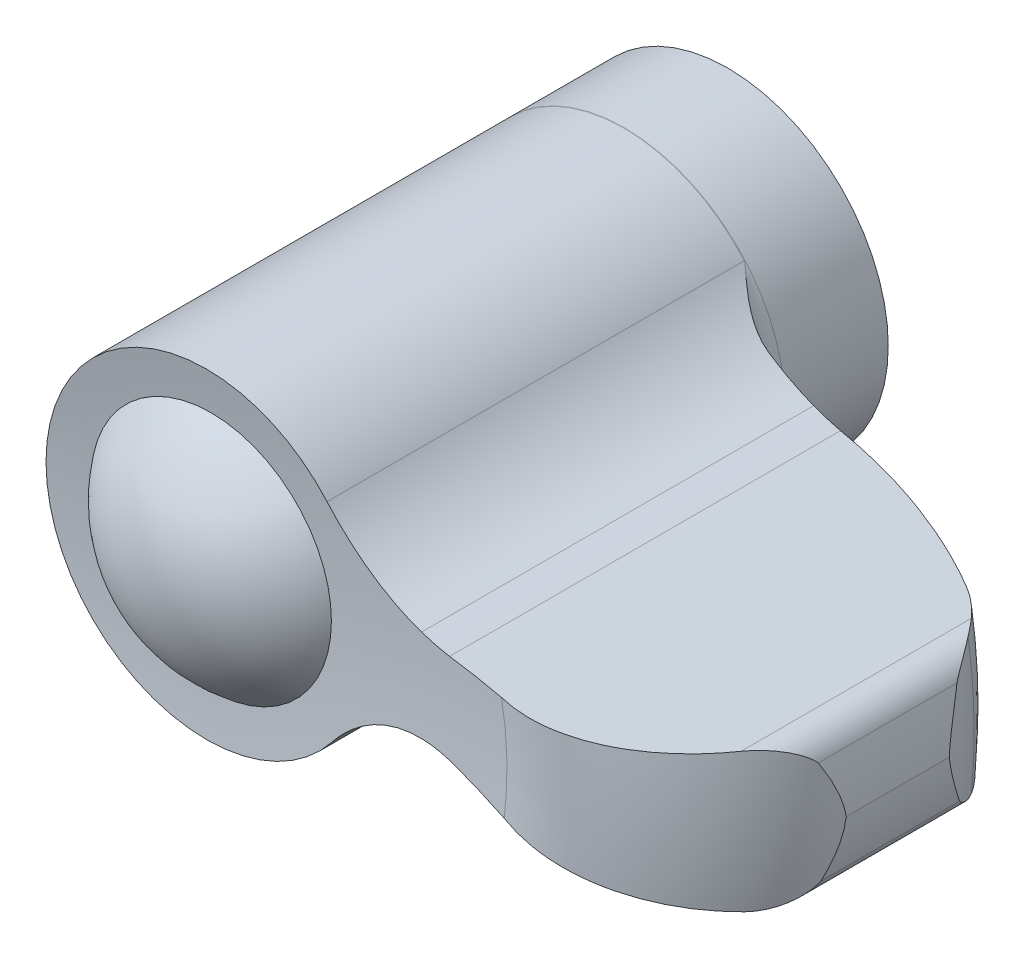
ISO-10303-21;
HEADER;
FILE_DESCRIPTION(('STEP AP214'),'2;1');
FILE_NAME('part.step','',(''),(''),'','','');
FILE_SCHEMA(('AUTOMOTIVE_DESIGN { 1 0 10303 214 1 1 1 1 }'));
ENDSEC;
DATA;
#1=APPLICATION_CONTEXT('core data for automotive mechanical design processes');
#2=APPLICATION_PROTOCOL_DEFINITION('international standard','automotive_design',2000,#1);
#3=PRODUCT_CONTEXT('',#1,'mechanical');
#4=PRODUCT('Part','Part','',(#3));
#5=PRODUCT_RELATED_PRODUCT_CATEGORY('part','',(#4));
#6=PRODUCT_DEFINITION_FORMATION('','',#4);
#7=PRODUCT_DEFINITION_CONTEXT('part definition',#1,'design');
#8=PRODUCT_DEFINITION('design','',#6,#7);
#9=PRODUCT_DEFINITION_SHAPE('','',#8);
#10=(LENGTH_UNIT() NAMED_UNIT(*) SI_UNIT(.MILLI.,.METRE.));
#11=(NAMED_UNIT(*) PLANE_ANGLE_UNIT() SI_UNIT($,.RADIAN.));
#12=(NAMED_UNIT(*) SI_UNIT($,.STERADIAN.) SOLID_ANGLE_UNIT());
#13=UNCERTAINTY_MEASURE_WITH_UNIT(LENGTH_MEASURE(1.E-05),#10,'distance_accuracy_value','');
#14=(GEOMETRIC_REPRESENTATION_CONTEXT(3) GLOBAL_UNCERTAINTY_ASSIGNED_CONTEXT((#13)) GLOBAL_UNIT_ASSIGNED_CONTEXT((#10,
#11,#12)) REPRESENTATION_CONTEXT('',''));
#15=CARTESIAN_POINT('',(0.,0.,0.));
#16=DIRECTION('',(0.,0.,1.));
#17=DIRECTION('',(1.,0.,0.));
#18=AXIS2_PLACEMENT_3D('',#15,#16,#17);
#19=CARTESIAN_POINT('',(0.,0.,24.3808550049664));
#20=DIRECTION('',(0.,0.,-1.));
#21=DIRECTION('',(0.,1.,0.));
#22=AXIS2_PLACEMENT_3D('',#19,#20,#21);
#23=TOROIDAL_SURFACE('',#22,24.5054208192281,10.9602391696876);
#24=CARTESIAN_POINT('',(34.3438095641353,4.01761439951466,20.0599898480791));
#25=CARTESIAN_POINT('',(34.3294678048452,4.04752396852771,20.0348823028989));
#26=CARTESIAN_POINT('',(34.3146874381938,4.07639678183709,20.0088418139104));
#27=CARTESIAN_POINT('',(34.2843623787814,4.13224051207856,19.9552686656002));
#28=CARTESIAN_POINT('',(34.2688184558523,4.15921328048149,19.9277375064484));
#29=CARTESIAN_POINT('',(34.2212855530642,4.23742764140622,19.8436007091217));
#30=CARTESIAN_POINT('',(34.1882864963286,4.28618634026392,19.7852583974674));
#31=CARTESIAN_POINT('',(34.1206474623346,4.37738860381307,19.6666980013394));
#32=CARTESIAN_POINT('',(34.0860452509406,4.41992599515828,19.606529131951));
#33=CARTESIAN_POINT('',(34.014865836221,4.50046903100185,19.484244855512));
#34=CARTESIAN_POINT('',(33.9782862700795,4.5384690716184,19.4221271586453));
#35=CARTESIAN_POINT('',(33.8856237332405,4.62738084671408,19.2670039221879));
#36=CARTESIAN_POINT('',(33.8284876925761,4.67591621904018,19.1732640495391));
#37=CARTESIAN_POINT('',(33.7105995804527,4.76509474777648,18.9843679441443));
#38=CARTESIAN_POINT('',(33.6498476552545,4.80573822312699,18.8892117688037));
#39=CARTESIAN_POINT('',(33.5232485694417,4.88052796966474,18.6957531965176));
#40=CARTESIAN_POINT('',(33.4573094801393,4.91447549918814,18.5974338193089));
#41=CARTESIAN_POINT('',(33.3558468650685,4.95953407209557,18.4499937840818));
#42=CARTESIAN_POINT('',(33.3216077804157,4.97357414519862,18.4008639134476));
#43=CARTESIAN_POINT('',(33.2522947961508,4.99968223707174,18.3026708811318));
#44=CARTESIAN_POINT('',(33.2172209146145,5.01175029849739,18.25360771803));
#45=CARTESIAN_POINT('',(33.1817391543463,5.02282188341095,18.204607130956));
#46=B_SPLINE_CURVE_WITH_KNOTS('',3,(#24,#25,#26,#27,#28,#29,#30,#31,#32,#33,#34,#35,#36,#37,#38,
#39,#40,#41,#42,#43,#44,#45),.UNSPECIFIED.,.F.,.F.,(4,2,2,2,2,2,2,2,2,2,4),(0.,
0.124730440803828,0.249337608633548,0.497617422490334,0.741646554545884,0.985974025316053,
1.34567597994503,1.70536339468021,2.07450027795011,2.25899132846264,2.44347838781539),.UNSPECIFIED.);
#47=CARTESIAN_POINT('',(34.3437136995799,4.01781439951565,20.059822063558));
#48=VERTEX_POINT('',#47);
#49=CARTESIAN_POINT('',(33.1818839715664,5.02277669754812,18.2048071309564));
#50=VERTEX_POINT('',#49);
#51=EDGE_CURVE('E9',#48,#50,#46,.T.);
#52=ORIENTED_EDGE('',*,*,#51,.F.);
#53=CARTESIAN_POINT('',(34.9753865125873,0.881069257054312,21.1755168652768));
#54=CARTESIAN_POINT('',(34.9608465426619,1.1073849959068,21.1466564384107));
#55=CARTESIAN_POINT('',(34.9399581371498,1.33096493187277,21.1043401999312));
#56=CARTESIAN_POINT('',(34.8866068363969,1.77080206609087,20.9984180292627));
#57=CARTESIAN_POINT('',(34.8541874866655,1.98708350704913,20.934892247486));
#58=CARTESIAN_POINT('',(34.7792903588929,2.40926076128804,20.792857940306));
#59=CARTESIAN_POINT('',(34.7369568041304,2.61525840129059,20.7145671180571));
#60=CARTESIAN_POINT('',(34.6427247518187,3.02047605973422,20.5467337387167));
#61=CARTESIAN_POINT('',(34.5908202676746,3.21969174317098,20.4571841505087));
#62=CARTESIAN_POINT('',(34.50508545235,3.51756906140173,20.3150265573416));
#63=CARTESIAN_POINT('',(34.4745375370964,3.61859958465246,20.2653176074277));
#64=CARTESIAN_POINT('',(34.4109393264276,3.81936178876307,20.1638972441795));
#65=CARTESIAN_POINT('',(34.3778801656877,3.91908725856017,20.1121790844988));
#66=CARTESIAN_POINT('',(34.343644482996,4.01801439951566,20.0597159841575));
#67=B_SPLINE_CURVE_WITH_KNOTS('',3,(#53,#54,#55,#56,#57,#58,#59,#60,#61,#62,#63,#64,#65,#66),
.UNSPECIFIED.,.F.,.F.,(4,2,2,2,2,2,4),(0.,0.684471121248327,1.36638437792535,2.03893436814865,
2.71190647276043,3.06186857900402,3.41312934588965),.UNSPECIFIED.);
#68=CARTESIAN_POINT('',(34.9753736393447,0.881269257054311,21.1754912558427));
#69=VERTEX_POINT('',#68);
#70=EDGE_CURVE('E28',#69,#48,#67,.T.);
#71=ORIENTED_EDGE('',*,*,#70,.F.);
#72=CARTESIAN_POINT('',(34.5024189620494,-2.28330723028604,20.0597176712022));
#73=CARTESIAN_POINT('',(34.5592230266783,-2.08772336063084,20.1616399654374));
#74=CARTESIAN_POINT('',(34.6114840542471,-1.88930335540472,20.2610202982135));
#75=CARTESIAN_POINT('',(34.7065822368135,-1.4854270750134,20.4519135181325));
#76=CARTESIAN_POINT('',(34.7493771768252,-1.27994382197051,20.5433900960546));
#77=CARTESIAN_POINT('',(34.823882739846,-0.86680415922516,20.7128880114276));
#78=CARTESIAN_POINT('',(34.8558134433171,-0.659291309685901,20.7911579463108));
#79=CARTESIAN_POINT('',(34.9090216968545,-0.238006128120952,20.9321159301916));
#80=CARTESIAN_POINT('',(34.93032082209,-0.0242474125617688,20.9948354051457));
#81=CARTESIAN_POINT('',(34.9540000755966,0.305522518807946,21.0746799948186));
#82=CARTESIAN_POINT('',(34.9605573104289,0.419441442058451,21.0992721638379));
#83=CARTESIAN_POINT('',(34.9704479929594,0.64921465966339,21.1422818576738));
#84=CARTESIAN_POINT('',(34.9737636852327,0.765076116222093,21.1606650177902));
#85=CARTESIAN_POINT('',(34.9753764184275,0.881469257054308,21.1755168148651));
#86=B_SPLINE_CURVE_WITH_KNOTS('',3,(#72,#73,#74,#75,#76,#77,#78,#79,#80,#81,#82,#83,#84,#85),
.UNSPECIFIED.,.F.,.F.,(4,2,2,2,2,2,4),(0.,0.683413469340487,1.36981585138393,2.04134543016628,
2.71150664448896,3.06148708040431,3.41337395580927),.UNSPECIFIED.);
#87=CARTESIAN_POINT('',(34.5024770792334,-2.28310723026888,20.0598220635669));
#88=VERTEX_POINT('',#87);
#89=EDGE_CURVE('E302',#88,#69,#86,.T.);
#90=ORIENTED_EDGE('',*,*,#89,.F.);
#91=CARTESIAN_POINT('',(33.3925909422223,-3.34535844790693,18.2046071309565));
#92=CARTESIAN_POINT('',(33.4351475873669,-3.32968468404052,18.2643930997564));
#93=CARTESIAN_POINT('',(33.4770217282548,-3.31256364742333,18.3242711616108));
#94=CARTESIAN_POINT('',(33.5593748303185,-3.27545901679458,18.4441062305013));
#95=CARTESIAN_POINT('',(33.5998536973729,-3.25547523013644,18.504063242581));
#96=CARTESIAN_POINT('',(33.7194300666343,-3.19112707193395,18.6843144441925));
#97=CARTESIAN_POINT('',(33.7963602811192,-3.14247920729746,18.8045565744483));
#98=CARTESIAN_POINT('',(33.9414473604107,-3.0354224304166,19.0393078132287));
#99=CARTESIAN_POINT('',(34.0098179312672,-2.97741818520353,19.1538695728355));
#100=CARTESIAN_POINT('',(34.1402980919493,-2.84945568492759,19.3796500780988));
#101=CARTESIAN_POINT('',(34.2024178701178,-2.77951740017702,19.490874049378));
#102=CARTESIAN_POINT('',(34.3058306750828,-2.64311275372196,19.6813659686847));
#103=CARTESIAN_POINT('',(34.3485832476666,-2.57970746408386,19.7619911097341));
#104=CARTESIAN_POINT('',(34.409204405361,-2.47601058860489,19.8781932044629));
#105=CARTESIAN_POINT('',(34.4289429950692,-2.43975012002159,19.9163694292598));
#106=CARTESIAN_POINT('',(34.4669374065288,-2.36391629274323,19.9902498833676));
#107=CARTESIAN_POINT('',(34.4851899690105,-2.32433601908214,20.0259486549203));
#108=CARTESIAN_POINT('',(34.5025608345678,-2.28290723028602,20.0599860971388));
#109=B_SPLINE_CURVE_WITH_KNOTS('',3,(#91,#92,#93,#94,#95,#96,#97,#98,#99,#100,#101,#102,#103,
#104,#105,#106,#107,#108),.UNSPECIFIED.,.F.,.F.,(4,2,2,2,2,2,2,2,4),(0.,0.225082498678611,
0.450180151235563,0.90199676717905,1.33788198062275,1.77304481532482,2.10572805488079,
2.27426699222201,2.44316614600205),.UNSPECIFIED.);
#110=CARTESIAN_POINT('',(33.3927333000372,-3.34530602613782,18.2048071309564));
#111=VERTEX_POINT('',#110);
#112=EDGE_CURVE('E309',#111,#88,#109,.T.);
#113=ORIENTED_EDGE('',*,*,#112,.F.);
#114=CARTESIAN_POINT('',(0.,0.,18.2048071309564));
#115=DIRECTION('',(0.,0.,-1.));
#116=DIRECTION('',(0.,1.,0.));
#117=AXIS2_PLACEMENT_3D('',#114,#115,#116);
#118=CIRCLE('',#117,33.5598824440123);
#119=EDGE_CURVE('E412',#50,#111,#118,.T.);
#120=ORIENTED_EDGE('',*,*,#119,.F.);
#121=EDGE_LOOP('',(#52,#71,#90,#113,#120));
#122=FACE_BOUND('',#121,.T.);
#123=ADVANCED_FACE('F14',(#122),#23,.T.);
#124=CARTESIAN_POINT('',(10.,0.,0.));
#125=DIRECTION('',(0.,0.,-1.));
#126=DIRECTION('',(0.,1.,0.));
#127=AXIS2_PLACEMENT_3D('',#124,#125,#126);
#128=PLANE('',#127);
#129=CARTESIAN_POINT('',(0.,0.,0.));
#130=DIRECTION('',(0.,0.,-1.));
#131=DIRECTION('',(-1.,0.,0.));
#132=AXIS2_PLACEMENT_3D('',#129,#130,#131);
#133=CIRCLE('',#132,5.);
#134=CARTESIAN_POINT('',(-5.,0.,0.));
#135=VERTEX_POINT('',#134);
#136=EDGE_CURVE('E383',#135,#135,#133,.T.);
#137=ORIENTED_EDGE('',*,*,#136,.F.);
#138=EDGE_LOOP('',(#137));
#139=FACE_BOUND('',#138,.T.);
#140=CARTESIAN_POINT('',(0.,0.,0.));
#141=DIRECTION('',(0.,0.,-1.));
#142=DIRECTION('',(0.,1.,0.));
#143=AXIS2_PLACEMENT_3D('',#140,#141,#142);
#144=CIRCLE('',#143,10.);
#145=CARTESIAN_POINT('',(0.,10.,0.));
#146=VERTEX_POINT('',#145);
#147=EDGE_CURVE('E135',#146,#146,#144,.T.);
#148=ORIENTED_EDGE('',*,*,#147,.T.);
#149=EDGE_LOOP('',(#148));
#150=FACE_BOUND('',#149,.T.);
#151=ADVANCED_FACE('F395',(#139,#150),#128,.T.);
#152=CARTESIAN_POINT('',(0.,0.,0.));
#153=DIRECTION('',(0.,0.,-1.));
#154=DIRECTION('',(0.,1.,0.));
#155=AXIS2_PLACEMENT_3D('',#152,#153,#154);
#156=CONICAL_SURFACE('',#155,10.,6.16148237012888E-05);
#157=CARTESIAN_POINT('',(0.,0.,6.44204681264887));
#158=DIRECTION('',(0.,0.,-1.));
#159=DIRECTION('',(0.,1.,0.));
#160=AXIS2_PLACEMENT_3D('',#157,#158,#159);
#161=CIRCLE('',#160,9.99960307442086);
#162=CARTESIAN_POINT('',(0.,9.99960307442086,6.44204681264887));
#163=VERTEX_POINT('',#162);
#164=EDGE_CURVE('E402',#163,#163,#161,.T.);
#165=ORIENTED_EDGE('',*,*,#164,.T.);
#166=EDGE_LOOP('',(#165));
#167=FACE_BOUND('',#166,.T.);
#168=ORIENTED_EDGE('',*,*,#147,.F.);
#169=EDGE_LOOP('',(#168));
#170=FACE_BOUND('',#169,.T.);
#171=ADVANCED_FACE('F398',(#167,#170),#156,.T.);
#172=CARTESIAN_POINT('',(0.,0.,6.44215771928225));
#173=DIRECTION('',(0.,0.,-1.));
#174=DIRECTION('',(0.,1.,0.));
#175=AXIS2_PLACEMENT_3D('',#172,#173,#174);
#176=TOROIDAL_SURFACE('',#175,11.7996030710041,1.8);
#177=CARTESIAN_POINT('',(10.7430133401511,4.16217888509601,8.22048385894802));
#178=CARTESIAN_POINT('',(10.630497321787,4.21551313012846,8.20702875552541));
#179=CARTESIAN_POINT('',(10.5196873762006,4.27063361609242,8.18784087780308));
#180=CARTESIAN_POINT('',(10.3020511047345,4.38389669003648,8.13980454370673));
#181=CARTESIAN_POINT('',(10.1952168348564,4.44203262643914,8.1109766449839));
#182=CARTESIAN_POINT('',(9.9864233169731,4.56055200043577,8.04564354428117));
#183=CARTESIAN_POINT('',(9.88443309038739,4.62091490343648,8.00919860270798));
#184=CARTESIAN_POINT('',(9.68443780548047,4.74404139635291,7.92984647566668));
#185=CARTESIAN_POINT('',(9.58643507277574,4.80680634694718,7.88693558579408));
#186=CARTESIAN_POINT('',(9.30097108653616,4.99659956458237,7.75155811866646));
#187=CARTESIAN_POINT('',(9.11919402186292,5.12676590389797,7.65148050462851));
#188=CARTESIAN_POINT('',(8.76947178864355,5.39475611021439,7.43778918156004));
#189=CARTESIAN_POINT('',(8.60155143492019,5.53259300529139,7.32415204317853));
#190=CARTESIAN_POINT('',(8.33896665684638,5.76249254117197,7.13300068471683));
#191=CARTESIAN_POINT('',(8.24048246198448,5.85229634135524,7.05795543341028));
#192=CARTESIAN_POINT('',(8.04804661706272,6.03486828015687,6.90577862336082));
#193=CARTESIAN_POINT('',(7.95409378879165,6.12763563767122,6.82864761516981));
#194=CARTESIAN_POINT('',(7.82461697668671,6.26062368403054,6.71969492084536));
#195=CARTESIAN_POINT('',(7.78744764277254,6.2994214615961,6.68809695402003));
#196=CARTESIAN_POINT('',(7.71377674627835,6.37756667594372,6.62501383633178));
#197=CARTESIAN_POINT('',(7.67727439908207,6.4169133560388,6.59352859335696));
#198=CARTESIAN_POINT('',(7.62727787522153,6.47169702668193,6.55151159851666));
#199=CARTESIAN_POINT('',(7.61380846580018,6.48654454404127,6.54030181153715));
#200=CARTESIAN_POINT('',(7.58674749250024,6.51655444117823,6.51849271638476));
#201=CARTESIAN_POINT('',(7.57315565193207,6.5317179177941,6.50789630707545));
#202=CARTESIAN_POINT('',(7.5471488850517,6.56092306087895,6.49073411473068));
#203=CARTESIAN_POINT('',(7.53489449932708,6.57475497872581,6.48379451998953));
#204=CARTESIAN_POINT('',(7.51929201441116,6.59247239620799,6.48096245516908));
#205=CARTESIAN_POINT('',(7.51632922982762,6.59584129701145,6.48067903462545));
#206=CARTESIAN_POINT('',(7.51334418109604,6.59924021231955,6.4806929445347));
#207=B_SPLINE_CURVE_WITH_KNOTS('',3,(#177,#178,#179,#180,#181,#182,#183,#184,#185,#186,#187,
#188,#189,#190,#191,#192,#193,#194,#195,#196,#197,#198,#199,#200,#201,#202,#203,#204,#205,#206),
.UNSPECIFIED.,.F.,.F.,(4,2,2,2,2,2,2,2,2,2,2,2,2,2,4),(0.,0.375343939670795,0.749892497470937,
1.12158305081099,1.49348736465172,2.227053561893,2.96190615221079,3.4206684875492,
3.87931088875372,4.06628560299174,4.25302400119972,4.32185672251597,4.39099189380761,
4.44904594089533,4.46252963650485),.UNSPECIFIED.);
#208=CARTESIAN_POINT('',(10.741339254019,4.16297278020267,8.220283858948));
#209=VERTEX_POINT('',#208);
#210=CARTESIAN_POINT('',(7.51351983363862,6.59904021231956,6.48069259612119));
#211=VERTEX_POINT('',#210);
#212=EDGE_CURVE('E238',#209,#211,#207,.T.);
#213=ORIENTED_EDGE('',*,*,#212,.F.);
#214=CARTESIAN_POINT('',(0.,0.,8.22028385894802));
#215=DIRECTION('',(0.,0.,-1.));
#216=DIRECTION('',(0.,1.,0.));
#217=AXIS2_PLACEMENT_3D('',#214,#215,#216);
#218=CIRCLE('',#217,11.5198399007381);
#219=CARTESIAN_POINT('',(10.9373634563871,-3.61673775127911,8.22028385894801));
#220=VERTEX_POINT('',#219);
#221=EDGE_CURVE('E404',#209,#220,#218,.T.);
#222=ORIENTED_EDGE('',*,*,#221,.T.);
#223=CARTESIAN_POINT('',(7.82828925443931,-6.22242194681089,6.48146822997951));
#224=CARTESIAN_POINT('',(7.82960016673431,-6.22076392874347,6.48121890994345));
#225=CARTESIAN_POINT('',(7.83091586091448,-6.21910092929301,6.48102611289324));
#226=CARTESIAN_POINT('',(7.83354275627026,-6.21578278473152,6.48076514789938));
#227=CARTESIAN_POINT('',(7.83485391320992,-6.2141276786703,6.48069602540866));
#228=CARTESIAN_POINT('',(7.8425792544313,-6.20438227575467,6.48067772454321));
#229=CARTESIAN_POINT('',(7.84901510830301,-6.1962898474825,6.48223961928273));
#230=CARTESIAN_POINT('',(7.86163525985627,-6.1804692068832,6.48740251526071));
#231=CARTESIAN_POINT('',(7.86781269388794,-6.17275051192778,6.49104073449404));
#232=CARTESIAN_POINT('',(7.89749910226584,-6.13576224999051,6.51030369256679));
#233=CARTESIAN_POINT('',(7.91990258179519,-6.10817474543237,6.53037970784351));
#234=CARTESIAN_POINT('',(7.96471891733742,-6.05356944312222,6.5705615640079));
#235=CARTESIAN_POINT('',(7.98713134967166,-6.02654975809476,6.59066693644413));
#236=CARTESIAN_POINT('',(8.05442052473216,-5.94628803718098,6.65130812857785));
#237=CARTESIAN_POINT('',(8.09956243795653,-5.89357791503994,6.6923576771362));
#238=CARTESIAN_POINT('',(8.19104187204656,-5.78898279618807,6.77416187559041));
#239=CARTESIAN_POINT('',(8.23737988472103,-5.73709815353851,6.81491639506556));
#240=CARTESIAN_POINT('',(8.33139920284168,-5.63401697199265,6.8962129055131));
#241=CARTESIAN_POINT('',(8.37908388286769,-5.58282274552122,6.93675399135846));
#242=CARTESIAN_POINT('',(8.47574470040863,-5.48121609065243,7.01725433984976));
#243=CARTESIAN_POINT('',(8.52472077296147,-5.43080362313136,7.05721363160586));
#244=CARTESIAN_POINT('',(8.6953185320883,-5.25888281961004,7.19326138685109));
#245=CARTESIAN_POINT('',(8.82027683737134,-5.13922437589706,7.28756082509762));
#246=CARTESIAN_POINT('',(9.07908971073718,-4.9041796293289,7.46932229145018));
#247=CARTESIAN_POINT('',(9.2129489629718,-4.78879562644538,7.556780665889));
#248=CARTESIAN_POINT('',(9.48973768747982,-4.56300957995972,7.7213953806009));
#249=CARTESIAN_POINT('',(9.63262543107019,-4.4525881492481,7.79859463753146));
#250=CARTESIAN_POINT('',(9.92852764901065,-4.23681653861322,7.93921490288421));
#251=CARTESIAN_POINT('',(10.0815291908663,-4.13146016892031,8.00265307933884));
#252=CARTESIAN_POINT('',(10.3512284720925,-3.95692910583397,8.09484090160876));
#253=CARTESIAN_POINT('',(10.4653276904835,-3.88624617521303,8.1283033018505));
#254=CARTESIAN_POINT('',(10.6985891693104,-3.74828472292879,8.18371933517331));
#255=CARTESIAN_POINT('',(10.8177582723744,-3.68101108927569,8.20565684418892));
#256=CARTESIAN_POINT('',(11.0722773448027,-3.54423740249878,8.23678391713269));
#257=CARTESIAN_POINT('',(11.2080586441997,-3.47518015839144,8.24449046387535));
#258=CARTESIAN_POINT('',(11.4821497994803,-3.34362864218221,8.23861205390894));
#259=CARTESIAN_POINT('',(11.6204505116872,-3.28111468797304,8.22509302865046));
#260=CARTESIAN_POINT('',(11.8033724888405,-3.20328804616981,8.19032693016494));
#261=CARTESIAN_POINT('',(11.8487199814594,-3.18439539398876,8.18031387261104));
#262=CARTESIAN_POINT('',(11.9390874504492,-3.14751402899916,8.15739222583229));
#263=CARTESIAN_POINT('',(11.9841071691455,-3.12952597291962,8.14448156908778));
#264=CARTESIAN_POINT('',(12.0288556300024,-3.1120168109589,8.13005877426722));
#265=B_SPLINE_CURVE_WITH_KNOTS('',3,(#223,#224,#225,#226,#227,#228,#229,#230,#231,#232,#233,
#234,#235,#236,#237,#238,#239,#240,#241,#242,#243,#244,#245,#246,#247,#248,#249,#250,#251,#252,
#253,#254,#255,#256,#257,#258,#259,#260,#261,#262,#263,#264),.UNSPECIFIED.,.F.,.F.,(4,2,2,2,2,2,
2,2,2,2,2,2,2,2,2,2,2,2,2,2,4),(0.,0.00638423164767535,0.0127189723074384,0.0436816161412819,
0.0752175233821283,0.197199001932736,0.318674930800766,0.560456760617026,0.802339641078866,
1.04489458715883,1.28743735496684,1.87823273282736,2.46934151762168,3.05789398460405,
3.64570790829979,4.06019099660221,4.47525243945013,4.93154966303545,5.38643232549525,
5.53676309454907,5.68720147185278),.UNSPECIFIED.);
#266=CARTESIAN_POINT('',(7.83632456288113,-6.21227247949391,6.48069259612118));
#267=VERTEX_POINT('',#266);
#268=EDGE_CURVE('E471',#267,#220,#265,.T.);
#269=ORIENTED_EDGE('',*,*,#268,.F.);
#270=CARTESIAN_POINT('',(0.,0.,6.48069259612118));
#271=DIRECTION('',(0.,0.,-1.));
#272=DIRECTION('',(0.,1.,0.));
#273=AXIS2_PLACEMENT_3D('',#270,#271,#272);
#274=CIRCLE('',#273,10.0000156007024);
#275=EDGE_CURVE('E470',#211,#267,#274,.F.);
#276=ORIENTED_EDGE('',*,*,#275,.F.);
#277=EDGE_LOOP('',(#213,#222,#269,#276));
#278=FACE_BOUND('',#277,.T.);
#279=ORIENTED_EDGE('',*,*,#164,.F.);
#280=EDGE_LOOP('',(#279));
#281=FACE_BOUND('',#280,.T.);
#282=ADVANCED_FACE('F209',(#278,#281),#176,.F.);
#283=CARTESIAN_POINT('',(0.,0.,58.3659074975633));
#284=DIRECTION('',(0.,0.,-1.));
#285=DIRECTION('',(0.,1.,0.));
#286=AXIS2_PLACEMENT_3D('',#283,#284,#285);
#287=DEGENERATE_TOROIDAL_SURFACE('',#286,3.63013043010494,50.7624968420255,.T.);
#288=CARTESIAN_POINT('',(30.2286083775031,4.84751677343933,15.3698887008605));
#289=CARTESIAN_POINT('',(29.6900824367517,4.78519127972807,15.029974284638));
#290=CARTESIAN_POINT('',(29.1452176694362,4.72213217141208,14.7003434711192));
#291=CARTESIAN_POINT('',(28.0435021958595,4.59462678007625,14.0620512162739));
#292=CARTESIAN_POINT('',(27.4866515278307,4.53018050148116,13.7533897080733));
#293=CARTESIAN_POINT('',(25.8057074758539,4.33563895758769,12.8629313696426));
#294=CARTESIAN_POINT('',(24.6649301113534,4.20361279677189,12.3126920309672));
#295=CARTESIAN_POINT('',(22.3455337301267,3.93518092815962,11.3000579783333));
#296=CARTESIAN_POINT('',(21.1669147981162,3.79877523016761,10.8376630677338));
#297=CARTESIAN_POINT('',(19.3724367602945,3.59109400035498,10.2107374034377));
#298=CARTESIAN_POINT('',(18.7680579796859,3.52114712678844,10.0123951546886));
#299=CARTESIAN_POINT('',(17.5522887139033,3.38044189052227,9.63883072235));
#300=CARTESIAN_POINT('',(16.9408982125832,3.30968352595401,9.46360859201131));
#301=CARTESIAN_POINT('',(16.3263843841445,3.23856368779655,9.30005916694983));
#302=B_SPLINE_CURVE_WITH_KNOTS('',3,(#288,#289,#290,#291,#292,#293,#294,#295,#296,#297,#298,
#299,#300,#301),.UNSPECIFIED.,.F.,.F.,(4,2,2,2,2,2,4),(0.,1.91938933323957,3.83877254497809,
7.65517359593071,11.4715661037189,13.3909453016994,15.3103289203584),.UNSPECIFIED.);
#303=CARTESIAN_POINT('',(30.2282915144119,4.84748010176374,15.3696887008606));
#304=VERTEX_POINT('',#303);
#305=CARTESIAN_POINT('',(16.3265843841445,3.2385868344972,9.30011239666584));
#306=VERTEX_POINT('',#305);
#307=EDGE_CURVE('E430',#304,#306,#302,.T.);
#308=ORIENTED_EDGE('',*,*,#307,.F.);
#309=CARTESIAN_POINT('',(0.,0.,15.3696887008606));
#310=DIRECTION('',(0.,0.,-1.));
#311=DIRECTION('',(0.,1.,0.));
#312=AXIS2_PLACEMENT_3D('',#309,#310,#311);
#313=CIRCLE('',#312,30.6145009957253);
#314=CARTESIAN_POINT('',(30.4340605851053,-3.31897989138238,15.3696887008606));
#315=VERTEX_POINT('',#314);
#316=EDGE_CURVE('E409',#304,#315,#313,.T.);
#317=ORIENTED_EDGE('',*,*,#316,.T.);
#318=CARTESIAN_POINT('',(16.4687674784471,-2.41222923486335,9.3000594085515));
#319=CARTESIAN_POINT('',(17.0860831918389,-2.45231084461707,9.4636088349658));
#320=CARTESIAN_POINT('',(17.7002613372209,-2.49218873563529,9.6388309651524));
#321=CARTESIAN_POINT('',(18.9215739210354,-2.57148717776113,10.0123953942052));
#322=CARTESIAN_POINT('',(19.5287083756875,-2.61090772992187,10.2107376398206));
#323=CARTESIAN_POINT('',(21.3313683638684,-2.72795240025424,10.8376632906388));
#324=CARTESIAN_POINT('',(22.5153612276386,-2.80482771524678,11.3000581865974));
#325=CARTESIAN_POINT('',(24.8453329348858,-2.95611013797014,12.3126921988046));
#326=CARTESIAN_POINT('',(25.9913116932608,-3.0305172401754,12.8629315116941));
#327=CARTESIAN_POINT('',(27.6799200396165,-3.14015666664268,13.7533898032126));
#328=CARTESIAN_POINT('',(28.2393096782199,-3.17647720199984,14.0620512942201));
#329=CARTESIAN_POINT('',(29.3460484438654,-3.24833649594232,14.7003435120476));
#330=CARTESIAN_POINT('',(29.8933975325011,-3.28387525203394,15.0299743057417));
#331=CARTESIAN_POINT('',(30.4343788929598,-3.31900055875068,15.3698887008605));
#332=B_SPLINE_CURVE_WITH_KNOTS('',3,(#318,#319,#320,#321,#322,#323,#324,#325,#326,#327,#328,
#329,#330,#331),.UNSPECIFIED.,.F.,.F.,(4,2,2,2,2,2,4),(0.,1.9193834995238,3.83876257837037,
7.65515485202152,11.4715556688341,13.3909387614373,15.3103279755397),.UNSPECIFIED.);
#333=CARTESIAN_POINT('',(16.4689674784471,-2.41224222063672,9.30011239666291));
#334=VERTEX_POINT('',#333);
#335=EDGE_CURVE('E192',#334,#315,#332,.T.);
#336=ORIENTED_EDGE('',*,*,#335,.F.);
#337=CARTESIAN_POINT('',(14.284178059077,-2.52138543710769,8.78195625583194));
#338=CARTESIAN_POINT('',(14.4662481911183,-2.4958557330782,8.82030539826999));
#339=CARTESIAN_POINT('',(14.6486277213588,-2.47446733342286,8.85992524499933));
#340=CARTESIAN_POINT('',(15.0132388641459,-2.43996628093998,8.94154927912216));
#341=CARTESIAN_POINT('',(15.1954700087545,-2.42683668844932,8.98354839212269));
#342=CARTESIAN_POINT('',(15.559768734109,-2.40874177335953,9.06993198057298));
#343=CARTESIAN_POINT('',(15.7418363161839,-2.40377638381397,9.11431643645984));
#344=CARTESIAN_POINT('',(16.1058112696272,-2.40193698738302,9.20548126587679));
#345=CARTESIAN_POINT('',(16.2877175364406,-2.40507968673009,9.25226639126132));
#346=CARTESIAN_POINT('',(16.4691674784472,-2.41225011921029,9.30016519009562));
#347=B_SPLINE_CURVE_WITH_KNOTS('',3,(#337,#338,#339,#340,#341,#342,#343,#344,#345,#346),
.UNSPECIFIED.,.F.,.F.,(4,2,2,2,4),(0.,0.563369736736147,1.12558014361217,1.68778594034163,
2.2511510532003),.UNSPECIFIED.);
#348=CARTESIAN_POINT('',(14.284378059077,-2.52135739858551,8.78199838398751));
#349=VERTEX_POINT('',#348);
#350=EDGE_CURVE('E142',#349,#334,#347,.T.);
#351=ORIENTED_EDGE('',*,*,#350,.F.);
#352=CARTESIAN_POINT('',(6.75387253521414,-7.90175007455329,8.05616735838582));
#353=CARTESIAN_POINT('',(6.87707615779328,-7.65872027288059,8.04210464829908));
#354=CARTESIAN_POINT('',(7.0103388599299,-7.42062596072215,8.03095882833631));
#355=CARTESIAN_POINT('',(7.2959602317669,-6.9559469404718,8.01440778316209));
#356=CARTESIAN_POINT('',(7.44832025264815,-6.72936304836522,8.00900296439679));
#357=CARTESIAN_POINT('',(7.77074432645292,-6.28985820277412,8.00384832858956));
#358=CARTESIAN_POINT('',(7.94076903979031,-6.07690852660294,8.00408620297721));
#359=CARTESIAN_POINT('',(8.29756486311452,-5.66565916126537,8.01019367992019));
#360=CARTESIAN_POINT('',(8.48433361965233,-5.46735742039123,8.01606249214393));
#361=CARTESIAN_POINT('',(8.84654039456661,-5.1129314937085,8.03231550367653));
#362=CARTESIAN_POINT('',(9.02001030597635,-4.95475549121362,8.04196864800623));
#363=CARTESIAN_POINT('',(9.37746960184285,-4.65112465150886,8.06561591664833));
#364=CARTESIAN_POINT('',(9.56145869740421,-4.50566946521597,8.07960992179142));
#365=CARTESIAN_POINT('',(9.93899692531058,-4.22817288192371,8.11203967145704));
#366=CARTESIAN_POINT('',(10.1325488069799,-4.09613537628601,8.13047669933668));
#367=CARTESIAN_POINT('',(10.5280915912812,-3.84616190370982,8.17187408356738));
#368=CARTESIAN_POINT('',(10.73008259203,-3.72822610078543,8.19483449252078));
#369=CARTESIAN_POINT('',(11.1504902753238,-3.50210469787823,8.24645089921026));
#370=CARTESIAN_POINT('',(11.3692382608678,-3.3945817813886,8.27531402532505));
#371=CARTESIAN_POINT('',(11.813393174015,-3.19601700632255,8.33804448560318));
#372=CARTESIAN_POINT('',(12.0388001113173,-3.104975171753,8.3719118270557));
#373=CARTESIAN_POINT('',(12.4946314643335,-2.93985653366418,8.444558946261));
#374=CARTESIAN_POINT('',(12.7250491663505,-2.86575839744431,8.48333245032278));
#375=CARTESIAN_POINT('',(13.1897622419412,-2.73465663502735,8.56571447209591));
#376=CARTESIAN_POINT('',(13.4240558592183,-2.67764547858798,8.60932084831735));
#377=CARTESIAN_POINT('',(13.7633646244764,-2.60791187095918,8.67549908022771));
#378=CARTESIAN_POINT('',(13.867368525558,-2.58825656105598,8.69618936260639));
#379=CARTESIAN_POINT('',(14.0757285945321,-2.55228927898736,8.73845464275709));
#380=CARTESIAN_POINT('',(14.1800845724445,-2.53597572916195,8.76002921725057));
#381=CARTESIAN_POINT('',(14.3305252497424,-2.5148891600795,8.79171917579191));
#382=CARTESIAN_POINT('',(14.3764990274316,-2.5087713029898,8.80148227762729));
#383=CARTESIAN_POINT('',(14.4224940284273,-2.50297590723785,8.81132895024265));
#384=B_SPLINE_CURVE_WITH_KNOTS('',3,(#352,#353,#354,#355,#356,#357,#358,#359,#360,#361,#362,
#363,#364,#365,#366,#367,#368,#369,#370,#371,#372,#373,#374,#375,#376,#377,#378,#379,#380,#381,
#382,#383),.UNSPECIFIED.,.F.,.F.,(4,2,2,2,2,2,2,2,2,2,2,2,2,2,2,4),(0.,0.818265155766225,
1.63658823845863,2.45312645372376,3.26955008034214,3.97381776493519,4.67806611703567,
5.38251813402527,6.08697834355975,6.82262178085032,7.5582662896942,8.29297943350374,
9.02736831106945,9.35087093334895,9.67422047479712,9.81640161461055),.UNSPECIFIED.);
#385=EDGE_CURVE('E191',#220,#349,#384,.T.);
#386=ORIENTED_EDGE('',*,*,#385,.F.);
#387=ORIENTED_EDGE('',*,*,#221,.F.);
#388=CARTESIAN_POINT('',(14.2332203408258,3.22961659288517,8.80178741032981));
#389=CARTESIAN_POINT('',(14.201968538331,3.23210503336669,8.79516681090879));
#390=CARTESIAN_POINT('',(14.1707184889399,3.23474150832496,8.78858434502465));
#391=CARTESIAN_POINT('',(13.8484884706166,3.26345683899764,8.72109869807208));
#392=CARTESIAN_POINT('',(13.5578039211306,3.30222662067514,8.66348651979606));
#393=CARTESIAN_POINT('',(12.9795435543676,3.40550422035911,8.55529564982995));
#394=CARTESIAN_POINT('',(12.6919703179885,3.47003194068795,8.50472243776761));
#395=CARTESIAN_POINT('',(12.1218821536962,3.62478993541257,8.41077186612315));
#396=CARTESIAN_POINT('',(11.839380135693,3.71507800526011,8.36741103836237));
#397=CARTESIAN_POINT('',(11.2826890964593,3.92078246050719,8.28815618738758));
#398=CARTESIAN_POINT('',(11.0084972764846,4.03619027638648,8.25225962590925));
#399=CARTESIAN_POINT('',(10.5193523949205,4.26831853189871,8.19371449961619));
#400=CARTESIAN_POINT('',(10.3026383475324,4.38104378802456,8.16984420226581));
#401=CARTESIAN_POINT('',(9.87760812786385,4.62233196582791,8.12702543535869));
#402=CARTESIAN_POINT('',(9.66929444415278,4.75089953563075,8.10807841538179));
#403=CARTESIAN_POINT('',(9.26263117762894,5.02301136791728,8.07503911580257));
#404=CARTESIAN_POINT('',(9.06427057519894,5.16653850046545,8.06094136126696));
#405=CARTESIAN_POINT('',(8.67850836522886,5.46785472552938,8.03746464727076));
#406=CARTESIAN_POINT('',(8.49110320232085,5.62563914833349,8.02808414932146));
#407=CARTESIAN_POINT('',(8.11295976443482,5.96853359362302,8.01334111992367));
#408=CARTESIAN_POINT('',(7.92327578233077,6.15482595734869,8.00838465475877));
#409=CARTESIAN_POINT('',(7.55930324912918,6.54196759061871,8.00382985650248));
#410=CARTESIAN_POINT('',(7.38501583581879,6.74281793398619,8.00423191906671));
#411=CARTESIAN_POINT('',(7.05264446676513,7.15819778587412,8.01040535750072));
#412=CARTESIAN_POINT('',(6.89459914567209,7.37275802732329,8.01618922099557));
#413=CARTESIAN_POINT('',(6.59620067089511,7.81363617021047,8.03323536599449));
#414=CARTESIAN_POINT('',(6.45584727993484,8.03995391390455,8.04449757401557));
#415=CARTESIAN_POINT('',(6.32485037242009,8.27140310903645,8.05854468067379));
#416=B_SPLINE_CURVE_WITH_KNOTS('',3,(#388,#389,#390,#391,#392,#393,#394,#395,#396,#397,#398,
#399,#400,#401,#402,#403,#404,#405,#406,#407,#408,#409,#410,#411,#412,#413,#414,#415),
.UNSPECIFIED.,.F.,.F.,(4,2,2,2,2,2,2,2,2,2,2,2,2,4),(0.,0.0961315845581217,0.991355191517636,
1.88727185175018,2.78521459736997,3.68285149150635,4.41850170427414,5.15436827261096,
5.88940128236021,6.62419441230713,7.42102103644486,8.21790649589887,9.01664562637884,
9.81537404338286),.UNSPECIFIED.);
#417=CARTESIAN_POINT('',(14.1392718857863,3.23754385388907,8.78199838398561));
#418=VERTEX_POINT('',#417);
#419=EDGE_CURVE('E221',#418,#209,#416,.T.);
#420=ORIENTED_EDGE('',*,*,#419,.F.);
#421=CARTESIAN_POINT('',(16.3267843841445,3.23860485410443,9.30016536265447));
#422=CARTESIAN_POINT('',(16.1459258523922,3.22230538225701,9.25226657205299));
#423=CARTESIAN_POINT('',(15.9644087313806,3.21000554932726,9.20548145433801));
#424=CARTESIAN_POINT('',(15.6008030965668,3.19351218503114,9.1143166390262));
#425=CARTESIAN_POINT('',(15.4187165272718,3.18930202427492,9.06993218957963));
#426=CARTESIAN_POINT('',(15.0539688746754,3.18902723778,8.98354861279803));
#427=CARTESIAN_POINT('',(14.8713077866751,3.19296267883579,8.94154950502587));
#428=CARTESIAN_POINT('',(14.5054218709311,3.20905746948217,8.85992548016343));
#429=CARTESIAN_POINT('',(14.3221966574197,3.22123376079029,8.82030563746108));
#430=CARTESIAN_POINT('',(14.1390718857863,3.23756168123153,8.78195649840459));
#431=B_SPLINE_CURVE_WITH_KNOTS('',3,(#421,#422,#423,#424,#425,#426,#427,#428,#429,#430),
.UNSPECIFIED.,.F.,.F.,(4,2,2,2,4),(0.,0.563364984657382,1.1255706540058,1.68778093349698,
2.25115054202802),.UNSPECIFIED.);
#432=EDGE_CURVE('E230',#306,#418,#431,.T.);
#433=ORIENTED_EDGE('',*,*,#432,.F.);
#434=EDGE_LOOP('',(#308,#317,#336,#351,#386,#387,#420,#433));
#435=FACE_BOUND('',#434,.T.);
#436=ADVANCED_FACE('F203',(#435),#287,.T.);
#437=CARTESIAN_POINT('',(0.,0.,23.8397643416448));
#438=DIRECTION('',(0.,0.,-1.));
#439=DIRECTION('',(0.,1.,0.));
#440=AXIS2_PLACEMENT_3D('',#437,#438,#439);
#441=TOROIDAL_SURFACE('',#440,25.2986926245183,10.);
#442=CARTESIAN_POINT('',(33.1820287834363,5.02273150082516,18.2050071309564));
#443=CARTESIAN_POINT('',(33.120427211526,5.04194380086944,18.1199161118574));
#444=CARTESIAN_POINT('',(33.0574737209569,5.05820941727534,18.0351105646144));
#445=CARTESIAN_POINT('',(32.9293771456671,5.0843480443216,17.866804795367));
#446=CARTESIAN_POINT('',(32.8642455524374,5.0942503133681,17.783300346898));
#447=CARTESIAN_POINT('',(32.7317225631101,5.10734989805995,17.6175244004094));
#448=CARTESIAN_POINT('',(32.6643308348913,5.11054622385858,17.5352530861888));
#449=CARTESIAN_POINT('',(32.527329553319,5.10963136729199,17.371974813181));
#450=CARTESIAN_POINT('',(32.4577111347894,5.10548609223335,17.2909755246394));
#451=CARTESIAN_POINT('',(32.3873120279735,5.09735109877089,17.2110075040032));
#452=B_SPLINE_CURVE_WITH_KNOTS('',3,(#442,#443,#444,#445,#446,#447,#448,#449,#450,#451),
.UNSPECIFIED.,.F.,.F.,(4,2,2,2,4),(0.,0.320355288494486,0.639226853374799,0.958145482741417,
1.27854898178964),.UNSPECIFIED.);
#453=CARTESIAN_POINT('',(32.3875120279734,5.09737425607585,17.2112347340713));
#454=VERTEX_POINT('',#453);
#455=EDGE_CURVE('E419',#50,#454,#452,.T.);
#456=ORIENTED_EDGE('',*,*,#455,.F.);
#457=ORIENTED_EDGE('',*,*,#119,.T.);
#458=CARTESIAN_POINT('',(32.6029262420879,-3.45980187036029,17.2110085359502));
#459=CARTESIAN_POINT('',(32.6736456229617,-3.4643810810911,17.2909764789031));
#460=CARTESIAN_POINT('',(32.7433843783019,-3.46501496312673,17.3719756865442));
#461=CARTESIAN_POINT('',(32.8802577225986,-3.45902899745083,17.5352537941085));
#462=CARTESIAN_POINT('',(32.9474028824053,-3.45244275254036,17.6175250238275));
#463=CARTESIAN_POINT('',(33.0790978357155,-3.43268569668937,17.7833007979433));
#464=CARTESIAN_POINT('',(33.1436480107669,-3.41951585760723,17.8668051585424));
#465=CARTESIAN_POINT('',(33.2702655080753,-3.38695925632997,18.0351107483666));
#466=CARTESIAN_POINT('',(33.3323198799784,-3.36754385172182,18.1199162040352));
#467=CARTESIAN_POINT('',(33.3928756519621,-3.34525359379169,18.2050071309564));
#468=B_SPLINE_CURVE_WITH_KNOTS('',3,(#458,#459,#460,#461,#462,#463,#464,#465,#466,#467),
.UNSPECIFIED.,.F.,.F.,(4,2,2,2,4),(0.,0.320403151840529,0.639321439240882,0.958192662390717,
1.27854760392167),.UNSPECIFIED.);
#469=CARTESIAN_POINT('',(32.6031262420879,-3.45981486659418,17.2112347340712));
#470=VERTEX_POINT('',#469);
#471=EDGE_CURVE('E425',#470,#111,#468,.T.);
#472=ORIENTED_EDGE('',*,*,#471,.F.);
#473=CARTESIAN_POINT('',(30.4337422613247,-3.31895922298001,15.3694887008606));
#474=CARTESIAN_POINT('',(30.6357159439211,-3.33207314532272,15.4963644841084));
#475=CARTESIAN_POINT('',(30.8331395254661,-3.34489163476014,15.6305096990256));
#476=CARTESIAN_POINT('',(31.2169341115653,-3.36981098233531,15.9118849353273));
#477=CARTESIAN_POINT('',(31.4033561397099,-3.38191515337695,16.0590450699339));
#478=CARTESIAN_POINT('',(31.765265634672,-3.40541352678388,16.3662997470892));
#479=CARTESIAN_POINT('',(31.9407530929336,-3.41680772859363,16.5263942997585));
#480=CARTESIAN_POINT('',(32.280780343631,-3.4388853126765,16.8595393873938));
#481=CARTESIAN_POINT('',(32.4452597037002,-3.44956477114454,17.0326518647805));
#482=CARTESIAN_POINT('',(32.6033262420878,-3.45982785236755,17.2114609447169));
#483=B_SPLINE_CURVE_WITH_KNOTS('',3,(#473,#474,#475,#476,#477,#478,#479,#480,#481,#482),
.UNSPECIFIED.,.F.,.F.,(4,2,2,2,4),(0.,0.716478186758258,1.42931893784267,2.14216024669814,
2.85863899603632),.UNSPECIFIED.);
#484=EDGE_CURVE('E346',#315,#470,#483,.T.);
#485=ORIENTED_EDGE('',*,*,#484,.F.);
#486=ORIENTED_EDGE('',*,*,#316,.F.);
#487=CARTESIAN_POINT('',(32.3877120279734,5.0973974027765,17.2114619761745));
#488=CARTESIAN_POINT('',(32.2303628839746,5.07918683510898,17.0326527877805));
#489=CARTESIAN_POINT('',(32.0666300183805,5.0602374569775,16.8595402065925));
#490=CARTESIAN_POINT('',(31.728145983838,5.02106351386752,16.526394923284));
#491=CARTESIAN_POINT('',(31.5534549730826,5.00084591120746,16.3663002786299));
#492=CARTESIAN_POINT('',(31.193187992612,4.95915095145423,16.0590454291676));
#493=CARTESIAN_POINT('',(31.007612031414,4.9376735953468,15.9118852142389));
#494=CARTESIAN_POINT('',(30.6255592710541,4.89345729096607,15.630509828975));
#495=CARTESIAN_POINT('',(30.4290316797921,4.87071246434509,15.4963645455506));
#496=CARTESIAN_POINT('',(30.2279746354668,4.84744342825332,15.3694887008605));
#497=B_SPLINE_CURVE_WITH_KNOTS('',3,(#487,#488,#489,#490,#491,#492,#493,#494,#495,#496),
.UNSPECIFIED.,.F.,.F.,(4,2,2,2,4),(0.,0.716479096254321,1.42932074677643,2.14216183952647,
2.85864037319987),.UNSPECIFIED.);
#498=EDGE_CURVE('E435',#454,#304,#497,.T.);
#499=ORIENTED_EDGE('',*,*,#498,.F.);
#500=EDGE_LOOP('',(#456,#457,#472,#485,#486,#499));
#501=FACE_BOUND('',#500,.T.);
#502=ADVANCED_FACE('F208',(#501),#441,.T.);
#503=CARTESIAN_POINT('',(23.0649537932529,0.114540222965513,35.9999999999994));
#504=DIRECTION('',(0.,0.,-1.));
#505=DIRECTION('',(0.,1.,0.));
#506=AXIS2_PLACEMENT_3D('',#503,#504,#505);
#507=CYLINDRICAL_SURFACE('',#506,11.9350732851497);
#508=ORIENTED_EDGE('',*,*,#70,.T.);
#509=DIRECTION('',(0.,0.,-1.));
#510=VECTOR('',#509,1.);
#511=CARTESIAN_POINT('',(34.3437136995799,4.01781439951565,35.9999999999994));
#512=LINE('',#511,#510);
#513=CARTESIAN_POINT('',(34.3437136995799,4.01781439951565,28.7018879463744));
#514=VERTEX_POINT('',#513);
#515=EDGE_CURVE('E350',#514,#48,#512,.T.);
#516=ORIENTED_EDGE('',*,*,#515,.F.);
#517=CARTESIAN_POINT('',(34.3436444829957,4.01801439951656,28.7019940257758));
#518=CARTESIAN_POINT('',(34.4102264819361,3.82553942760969,28.6000716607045));
#519=CARTESIAN_POINT('',(34.472414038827,3.63000312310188,28.5006912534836));
#520=CARTESIAN_POINT('',(34.5877315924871,3.2314285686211,28.3097978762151));
#521=CARTESIAN_POINT('',(34.6408207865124,3.0283612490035,28.2183212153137));
#522=CARTESIAN_POINT('',(34.7360383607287,2.61949798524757,28.04882312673));
#523=CARTESIAN_POINT('',(34.7783793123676,2.41385650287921,27.9705531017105));
#524=CARTESIAN_POINT('',(34.8527368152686,1.99578548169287,27.8295949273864));
#525=CARTESIAN_POINT('',(34.8847742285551,1.78337062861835,27.7668753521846));
#526=CARTESIAN_POINT('',(34.9250313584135,1.45521114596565,27.6870304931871));
#527=CARTESIAN_POINT('',(34.937317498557,1.34176651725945,27.6624381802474));
#528=CARTESIAN_POINT('',(34.9587675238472,1.11278196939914,27.6194282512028));
#529=CARTESIAN_POINT('',(34.9679140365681,0.997234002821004,27.6010450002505));
#530=CARTESIAN_POINT('',(34.9753865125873,0.881069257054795,27.586193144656));
#531=B_SPLINE_CURVE_WITH_KNOTS('',3,(#517,#518,#519,#520,#521,#522,#523,#524,#525,#526,#527,
#528,#529,#530),.UNSPECIFIED.,.F.,.F.,(4,2,2,2,2,2,4),(0.,0.683413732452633,1.36981637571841,
2.04134620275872,2.71150766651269,3.06148966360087,3.41337811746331),.UNSPECIFIED.);
#532=CARTESIAN_POINT('',(34.9753736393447,0.881269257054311,27.5862187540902));
#533=VERTEX_POINT('',#532);
#534=EDGE_CURVE('E330',#514,#533,#531,.T.);
#535=ORIENTED_EDGE('',*,*,#534,.T.);
#536=DIRECTION('',(0.,0.,-1.));
#537=VECTOR('',#536,1.);
#538=CARTESIAN_POINT('',(34.9753736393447,0.881269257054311,35.9999999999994));
#539=LINE('',#538,#537);
#540=EDGE_CURVE('E380',#533,#69,#539,.T.);
#541=ORIENTED_EDGE('',*,*,#540,.T.);
#542=EDGE_LOOP('',(#508,#516,#535,#541));
#543=FACE_BOUND('',#542,.T.);
#544=ADVANCED_FACE('F323',(#543),#507,.T.);
#545=CARTESIAN_POINT('',(32.6087143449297,3.18606671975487,35.9999999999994));
#546=DIRECTION('',(0.,0.,-1.));
#547=DIRECTION('',(0.,1.,0.));
#548=AXIS2_PLACEMENT_3D('',#545,#546,#547);
#549=CYLINDRICAL_SURFACE('',#548,1.92406521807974);
#550=ORIENTED_EDGE('',*,*,#455,.T.);
#551=DIRECTION('',(0.,0.,-1.));
#552=VECTOR('',#551,1.);
#553=CARTESIAN_POINT('',(32.3875120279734,5.09737425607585,35.9999999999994));
#554=LINE('',#553,#552);
#555=CARTESIAN_POINT('',(32.3875120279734,5.09737425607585,31.5610867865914));
#556=VERTEX_POINT('',#555);
#557=EDGE_CURVE('E353',#556,#454,#554,.T.);
#558=ORIENTED_EDGE('',*,*,#557,.F.);
#559=CARTESIAN_POINT('',(32.3873120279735,5.09735109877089,31.5613187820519));
#560=CARTESIAN_POINT('',(32.4715485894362,5.10706333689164,31.4636360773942));
#561=CARTESIAN_POINT('',(32.5547553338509,5.11110781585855,31.3646111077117));
#562=CARTESIAN_POINT('',(32.7185006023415,5.10875107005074,31.1646149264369));
#563=CARTESIAN_POINT('',(32.799041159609,5.10235800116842,31.0636452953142));
#564=CARTESIAN_POINT('',(32.9585726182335,5.0798030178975,30.858291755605));
#565=CARTESIAN_POINT('',(33.0374994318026,5.06344653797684,30.753880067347));
#566=CARTESIAN_POINT('',(33.191735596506,5.0214157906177,30.5442451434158));
#567=CARTESIAN_POINT('',(33.2670442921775,4.99573984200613,30.439021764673));
#568=CARTESIAN_POINT('',(33.4165766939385,4.93425777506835,30.2243777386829));
#569=CARTESIAN_POINT('',(33.4906476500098,4.89810047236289,30.1149510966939));
#570=CARTESIAN_POINT('',(33.6343172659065,4.81610020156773,29.8968108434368));
#571=CARTESIAN_POINT('',(33.7039164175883,4.77025830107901,29.7880971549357));
#572=CARTESIAN_POINT('',(33.837715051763,4.66882634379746,29.5736137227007));
#573=CARTESIAN_POINT('',(33.9019625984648,4.61334110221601,29.4678252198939));
#574=CARTESIAN_POINT('',(33.9945035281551,4.52154075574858,29.3120353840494));
#575=CARTESIAN_POINT('',(34.0246980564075,4.48952991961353,29.2606124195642));
#576=CARTESIAN_POINT('',(34.0837403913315,4.42232209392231,29.1590966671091));
#577=CARTESIAN_POINT('',(34.1125883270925,4.38712541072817,29.1090037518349));
#578=CARTESIAN_POINT('',(34.1773490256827,4.30190285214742,28.9957376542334));
#579=CARTESIAN_POINT('',(34.2127543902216,4.2506148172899,28.9331993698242));
#580=CARTESIAN_POINT('',(34.2636704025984,4.16800177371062,28.8430894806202));
#581=CARTESIAN_POINT('',(34.2803096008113,4.13945146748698,28.813611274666));
#582=CARTESIAN_POINT('',(34.3127352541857,4.08020013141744,28.7563090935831));
#583=CARTESIAN_POINT('',(34.3285204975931,4.04949618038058,28.7284874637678));
#584=CARTESIAN_POINT('',(34.3438095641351,4.01761439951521,28.7017201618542));
#585=B_SPLINE_CURVE_WITH_KNOTS('',3,(#559,#560,#561,#562,#563,#564,#565,#566,#567,#568,#569,
#570,#571,#572,#573,#574,#575,#576,#577,#578,#579,#580,#581,#582,#583,#584),.UNSPECIFIED.,.F.,
.F.,(4,2,2,2,2,2,2,2,2,2,2,2,4),(0.,0.387801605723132,0.775300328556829,1.17062014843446,
1.56601131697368,1.97658776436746,2.38711897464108,2.79343915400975,2.99639770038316,
3.19933675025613,3.46375738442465,3.5965249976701,3.72947631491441),.UNSPECIFIED.);
#586=EDGE_CURVE('E310',#556,#514,#585,.T.);
#587=ORIENTED_EDGE('',*,*,#586,.T.);
#588=ORIENTED_EDGE('',*,*,#515,.T.);
#589=ORIENTED_EDGE('',*,*,#51,.T.);
#590=EDGE_LOOP('',(#550,#558,#587,#588,#589));
#591=FACE_BOUND('',#590,.T.);
#592=ADVANCED_FACE('F326',(#591),#549,.T.);
#593=CARTESIAN_POINT('',(16.3265843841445,3.2385868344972,35.9999999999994));
#594=DIRECTION('',(0.114966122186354,-0.993369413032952,0.));
#595=DIRECTION('',(0.993369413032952,0.114966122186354,0.));
#596=AXIS2_PLACEMENT_3D('',#593,#594,#595);
#597=PLANE('',#596);
#598=ORIENTED_EDGE('',*,*,#307,.T.);
#599=DIRECTION('',(0.,0.,-1.));
#600=VECTOR('',#599,1.);
#601=CARTESIAN_POINT('',(16.3265843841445,3.2385868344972,35.9999999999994));
#602=LINE('',#601,#600);
#603=CARTESIAN_POINT('',(16.3265843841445,3.2385868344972,33.6633346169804));
#604=VERTEX_POINT('',#603);
#605=EDGE_CURVE('E366',#604,#306,#602,.T.);
#606=ORIENTED_EDGE('',*,*,#605,.F.);
#607=CARTESIAN_POINT('',(16.3263843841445,3.23856368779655,33.6632900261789));
#608=CARTESIAN_POINT('',(17.0561936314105,3.32302706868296,33.8260077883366));
#609=CARTESIAN_POINT('',(17.7833113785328,3.40717895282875,33.9994540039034));
#610=CARTESIAN_POINT('',(19.232163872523,3.57485972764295,34.3678033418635));
#611=CARTESIAN_POINT('',(19.9538986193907,3.65838861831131,34.5627064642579));
#612=CARTESIAN_POINT('',(20.6729418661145,3.74160601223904,34.7683380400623));
#613=B_SPLINE_CURVE_WITH_KNOTS('',3,(#607,#608,#609,#610,#611,#612),.UNSPECIFIED.,.F.,.F.,(4,2,
4),(0.,2.25672065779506,4.51344131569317),.UNSPECIFIED.);
#614=CARTESIAN_POINT('',(20.6722425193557,3.74152507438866,34.7681380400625));
#615=VERTEX_POINT('',#614);
#616=EDGE_CURVE('E266',#604,#615,#613,.T.);
#617=ORIENTED_EDGE('',*,*,#616,.T.);
#618=CARTESIAN_POINT('',(16.3263843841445,3.23856368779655,32.0184360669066));
#619=CARTESIAN_POINT('',(16.5409556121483,3.26339676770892,32.2400807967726));
#620=CARTESIAN_POINT('',(16.7648648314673,3.28931056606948,32.4525543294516));
#621=CARTESIAN_POINT('',(17.2296505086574,3.34310184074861,32.8577549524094));
#622=CARTESIAN_POINT('',(17.4705260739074,3.37097921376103,33.0504830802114));
#623=CARTESIAN_POINT('',(17.9673656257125,3.42848019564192,33.4146709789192));
#624=CARTESIAN_POINT('',(18.2233177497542,3.45810243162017,33.586147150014));
#625=CARTESIAN_POINT('',(18.7486499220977,3.51890096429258,33.9067985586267));
#626=CARTESIAN_POINT('',(19.0180298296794,3.55007724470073,34.0559740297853));
#627=CARTESIAN_POINT('',(19.5684355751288,3.61377762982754,34.3310297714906));
#628=CARTESIAN_POINT('',(19.8494667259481,3.64630234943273,34.4568992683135));
#629=CARTESIAN_POINT('',(20.4210616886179,3.71245503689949,34.6843625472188));
#630=CARTESIAN_POINT('',(20.7116254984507,3.74608300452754,34.7859563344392));
#631=CARTESIAN_POINT('',(21.300184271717,3.814198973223,34.9641304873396));
#632=CARTESIAN_POINT('',(21.5981782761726,3.84868686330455,35.0407140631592));
#633=CARTESIAN_POINT('',(22.1995149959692,3.91828166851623,35.168334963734));
#634=CARTESIAN_POINT('',(22.5028576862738,3.95338858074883,35.2193724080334));
#635=CARTESIAN_POINT('',(23.1127693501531,4.02397579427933,35.2955351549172));
#636=CARTESIAN_POINT('',(23.4193386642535,4.05945613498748,35.3206576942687));
#637=CARTESIAN_POINT('',(24.0334910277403,4.13053413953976,35.3447938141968));
#638=CARTESIAN_POINT('',(24.3410740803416,4.16613180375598,35.3438073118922));
#639=CARTESIAN_POINT('',(24.955076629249,4.23719246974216,35.3157225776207));
#640=CARTESIAN_POINT('',(25.2614960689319,4.27265546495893,35.2886230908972));
#641=CARTESIAN_POINT('',(25.8709693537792,4.3431919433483,35.2084948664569));
#642=CARTESIAN_POINT('',(26.1740232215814,4.37826542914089,35.1554663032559));
#643=CARTESIAN_POINT('',(26.7742670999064,4.44773375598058,35.0239233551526));
#644=CARTESIAN_POINT('',(27.0714632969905,4.4821293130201,34.9454375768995));
#645=CARTESIAN_POINT('',(27.6582283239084,4.55003768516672,34.763511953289));
#646=CARTESIAN_POINT('',(27.9477970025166,4.58355048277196,34.6600716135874));
#647=CARTESIAN_POINT('',(28.5172124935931,4.64945093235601,34.4289765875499));
#648=CARTESIAN_POINT('',(28.7970599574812,4.6818386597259,34.3013235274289));
#649=CARTESIAN_POINT('',(29.3450523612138,4.74525974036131,34.0227008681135));
#650=CARTESIAN_POINT('',(29.6131977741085,4.77629314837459,33.8717322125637));
#651=CARTESIAN_POINT('',(30.1093822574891,4.83371831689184,33.563984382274));
#652=CARTESIAN_POINT('',(30.3387328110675,4.86026185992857,33.4093421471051));
#653=CARTESIAN_POINT('',(30.7851048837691,4.91192206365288,33.0829930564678));
#654=CARTESIAN_POINT('',(31.0021273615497,4.93703883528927,32.9112875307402));
#655=CARTESIAN_POINT('',(31.4225903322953,4.98570048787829,32.5517918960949));
#656=CARTESIAN_POINT('',(31.6260311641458,5.00924540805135,32.3640021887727));
#657=CARTESIAN_POINT('',(32.0182021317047,5.05463272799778,31.9734102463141));
#658=CARTESIAN_POINT('',(32.2069305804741,5.07647493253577,31.7706062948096));
#659=CARTESIAN_POINT('',(32.3877120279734,5.0973974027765,31.5608547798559));
#660=B_SPLINE_CURVE_WITH_KNOTS('',3,(#618,#619,#620,#621,#622,#623,#624,#625,#626,#627,#628,
#629,#630,#631,#632,#633,#634,#635,#636,#637,#638,#639,#640,#641,#642,#643,#644,#645,#646,#647,
#648,#649,#650,#651,#652,#653,#654,#655,#656,#657,#658,#659),.UNSPECIFIED.,.F.,.F.,(4,2,2,2,2,2,
2,2,2,2,2,2,2,2,2,2,2,2,2,2,4),(0.,0.928183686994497,1.85631857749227,2.78373270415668,
3.71113711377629,4.6389691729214,5.5668010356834,6.49451376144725,7.42222214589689,
8.35002943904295,9.27783967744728,10.2056945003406,11.1335430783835,12.0603526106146,
12.9871805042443,13.9139461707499,14.8406743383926,15.6735468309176,16.5063544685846,
17.3391413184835,18.1720235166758),.UNSPECIFIED.);
#661=EDGE_CURVE('E237',#615,#556,#660,.T.);
#662=ORIENTED_EDGE('',*,*,#661,.T.);
#663=ORIENTED_EDGE('',*,*,#557,.T.);
#664=ORIENTED_EDGE('',*,*,#498,.T.);
#665=EDGE_LOOP('',(#598,#606,#617,#662,#663,#664));
#666=FACE_BOUND('',#665,.T.);
#667=ADVANCED_FACE('F253',(#666),#597,.F.);
#668=CARTESIAN_POINT('',(15.2271085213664,15.4428114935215,35.9999999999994));
#669=DIRECTION('',(0.,0.,-1.));
#670=DIRECTION('',(0.,1.,0.));
#671=AXIS2_PLACEMENT_3D('',#668,#669,#670);
#672=CYLINDRICAL_SURFACE('',#671,12.2536503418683);
#673=ORIENTED_EDGE('',*,*,#432,.T.);
#674=DIRECTION('',(0.,0.,-1.));
#675=VECTOR('',#674,1.);
#676=CARTESIAN_POINT('',(14.1392718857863,3.23754385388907,35.9999999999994));
#677=LINE('',#676,#675);
#678=CARTESIAN_POINT('',(14.1392718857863,3.23754385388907,33.219814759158));
#679=VERTEX_POINT('',#678);
#680=EDGE_CURVE('E369',#679,#418,#677,.T.);
#681=ORIENTED_EDGE('',*,*,#680,.F.);
#682=CARTESIAN_POINT('',(14.1390718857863,3.23756168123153,33.2197779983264));
#683=CARTESIAN_POINT('',(14.3217551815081,3.22127358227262,33.2533550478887));
#684=CARTESIAN_POINT('',(14.5046367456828,3.20910747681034,33.2878395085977));
#685=CARTESIAN_POINT('',(14.8700603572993,3.19300220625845,33.358478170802));
#686=CARTESIAN_POINT('',(15.0526023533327,3.18904665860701,33.394628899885));
#687=CARTESIAN_POINT('',(15.4173424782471,3.18928069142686,33.4685895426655));
#688=CARTESIAN_POINT('',(15.5995406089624,3.19347022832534,33.5063994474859));
#689=CARTESIAN_POINT('',(15.9635991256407,3.20995356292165,33.5836786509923));
#690=CARTESIAN_POINT('',(16.1454581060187,3.22226356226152,33.6231511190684));
#691=CARTESIAN_POINT('',(16.3267843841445,3.23860485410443,33.6633789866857));
#692=B_SPLINE_CURVE_WITH_KNOTS('',3,(#682,#683,#684,#685,#686,#687,#688,#689,#690,#691),
.UNSPECIFIED.,.F.,.F.,(4,2,2,2,4),(0.,0.559317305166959,1.11751752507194,1.67571475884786,
2.23502906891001),.UNSPECIFIED.);
#693=EDGE_CURVE('E259',#679,#604,#692,.T.);
#694=ORIENTED_EDGE('',*,*,#693,.T.);
#695=ORIENTED_EDGE('',*,*,#605,.T.);
#696=EDGE_LOOP('',(#673,#681,#694,#695));
#697=FACE_BOUND('',#696,.T.);
#698=ADVANCED_FACE('F249',(#697),#672,.F.);
#699=CARTESIAN_POINT('',(15.0270372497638,13.1980595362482,35.9999999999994));
#700=DIRECTION('',(0.,0.,-1.));
#701=DIRECTION('',(0.,1.,0.));
#702=AXIS2_PLACEMENT_3D('',#699,#700,#701);
#703=CYLINDRICAL_SURFACE('',#702,10.);
#704=ORIENTED_EDGE('',*,*,#212,.T.);
#705=DIRECTION('',(0.,0.,-1.));
#706=VECTOR('',#705,1.);
#707=CARTESIAN_POINT('',(7.51351983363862,6.59904021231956,35.9999999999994));
#708=LINE('',#707,#706);
#709=CARTESIAN_POINT('',(7.51351983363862,6.59904021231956,32.4908404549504));
#710=VERTEX_POINT('',#709);
#711=EDGE_CURVE('E372',#710,#211,#708,.T.);
#712=ORIENTED_EDGE('',*,*,#711,.F.);
#713=CARTESIAN_POINT('',(7.51334418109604,6.59924021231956,32.4908404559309));
#714=CARTESIAN_POINT('',(7.69316840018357,6.39443360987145,32.4908303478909));
#715=CARTESIAN_POINT('',(7.88140937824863,6.19702889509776,32.4937648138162));
#716=CARTESIAN_POINT('',(8.27325540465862,5.81832491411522,32.5054637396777));
#717=CARTESIAN_POINT('',(8.47685928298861,5.63702442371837,32.5142277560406));
#718=CARTESIAN_POINT('',(8.89791648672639,5.29185883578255,32.5375226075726));
#719=CARTESIAN_POINT('',(9.11536498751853,5.12798771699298,32.552051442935));
#720=CARTESIAN_POINT('',(9.56257595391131,4.81870628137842,32.586760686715));
#721=CARTESIAN_POINT('',(9.79233800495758,4.67329534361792,32.6069409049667));
#722=CARTESIAN_POINT('',(10.2629193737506,4.40163276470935,32.6528391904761));
#723=CARTESIAN_POINT('',(10.5037569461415,4.2754143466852,32.6785666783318));
#724=CARTESIAN_POINT('',(10.994389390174,4.04320231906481,32.7353459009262));
#725=CARTESIAN_POINT('',(11.2441843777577,3.93720897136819,32.766397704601));
#726=CARTESIAN_POINT('',(11.750604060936,3.7461743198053,32.8335498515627));
#727=CARTESIAN_POINT('',(12.0072191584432,3.66110513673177,32.8696433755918));
#728=CARTESIAN_POINT('',(12.5257219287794,3.51218672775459,32.9466379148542));
#729=CARTESIAN_POINT('',(12.7876072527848,3.44832826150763,32.9875368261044));
#730=CARTESIAN_POINT('',(13.2314721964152,3.35886431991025,33.060197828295));
#731=CARTESIAN_POINT('',(13.4125203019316,3.32754831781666,33.0907571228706));
#732=CARTESIAN_POINT('',(13.7754419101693,3.27500108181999,33.1538440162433));
#733=CARTESIAN_POINT('',(13.9573137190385,3.25375443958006,33.1863685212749));
#734=CARTESIAN_POINT('',(14.1394718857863,3.23752603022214,33.2198515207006));
#735=B_SPLINE_CURVE_WITH_KNOTS('',3,(#713,#714,#715,#716,#717,#718,#719,#720,#721,#722,#723,
#724,#725,#726,#727,#728,#729,#730,#731,#732,#733,#734),.UNSPECIFIED.,.F.,.F.,(4,2,2,2,2,2,2,2,
2,2,4),(0.,0.817388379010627,1.63471456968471,2.45175747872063,3.26877289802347,
4.08718689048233,4.90561148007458,5.72293962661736,6.53991123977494,7.09842529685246,
7.65608192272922),.UNSPECIFIED.);
#736=EDGE_CURVE('E267',#710,#679,#735,.T.);
#737=ORIENTED_EDGE('',*,*,#736,.T.);
#738=ORIENTED_EDGE('',*,*,#680,.T.);
#739=ORIENTED_EDGE('',*,*,#419,.T.);
#740=EDGE_LOOP('',(#704,#712,#737,#738,#739));
#741=FACE_BOUND('',#740,.T.);
#742=ADVANCED_FACE('F252',(#741),#703,.F.);
#743=CARTESIAN_POINT('',(0.,0.,35.9999999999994));
#744=DIRECTION('',(0.,0.,-1.));
#745=DIRECTION('',(0.,1.,0.));
#746=AXIS2_PLACEMENT_3D('',#743,#744,#745);
#747=CYLINDRICAL_SURFACE('',#746,10.0000156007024);
#748=ORIENTED_EDGE('',*,*,#275,.T.);
#749=DIRECTION('',(0.,0.,-1.));
#750=VECTOR('',#749,1.);
#751=CARTESIAN_POINT('',(7.83632456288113,-6.21227247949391,35.9999999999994));
#752=LINE('',#751,#750);
#753=CARTESIAN_POINT('',(7.83632456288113,-6.21227247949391,32.4908404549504));
#754=VERTEX_POINT('',#753);
#755=EDGE_CURVE('E375',#754,#267,#752,.T.);
#756=ORIENTED_EDGE('',*,*,#755,.F.);
#757=CARTESIAN_POINT('',(0.,0.,32.4908404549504));
#758=DIRECTION('',(0.,0.,1.));
#759=DIRECTION('',(0.,-1.,0.));
#760=AXIS2_PLACEMENT_3D('',#757,#758,#759);
#761=CIRCLE('',#760,10.0000156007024);
#762=EDGE_CURVE('E153',#754,#710,#761,.F.);
#763=ORIENTED_EDGE('',*,*,#762,.T.);
#764=ORIENTED_EDGE('',*,*,#711,.T.);
#765=EDGE_LOOP('',(#748,#756,#763,#764));
#766=FACE_BOUND('',#765,.T.);
#767=ADVANCED_FACE('F465',(#766),#747,.T.);
#768=CARTESIAN_POINT('',(15.6726456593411,-12.4245242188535,35.9999999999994));
#769=DIRECTION('',(0.,0.,-1.));
#770=DIRECTION('',(0.,1.,0.));
#771=AXIS2_PLACEMENT_3D('',#768,#769,#770);
#772=CYLINDRICAL_SURFACE('',#771,10.);
#773=ORIENTED_EDGE('',*,*,#268,.T.);
#774=ORIENTED_EDGE('',*,*,#385,.T.);
#775=DIRECTION('',(0.,0.,-1.));
#776=VECTOR('',#775,1.);
#777=CARTESIAN_POINT('',(14.284378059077,-2.52135739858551,35.9999999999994));
#778=LINE('',#777,#776);
#779=CARTESIAN_POINT('',(14.284378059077,-2.52135739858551,33.219814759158));
#780=VERTEX_POINT('',#779);
#781=EDGE_CURVE('E143',#780,#349,#778,.T.);
#782=ORIENTED_EDGE('',*,*,#781,.F.);
#783=CARTESIAN_POINT('',(14.284578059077,-2.52132936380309,33.2198517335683));
#784=CARTESIAN_POINT('',(14.1326470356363,-2.54262481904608,33.1917637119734));
#785=CARTESIAN_POINT('',(13.9811056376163,-2.56743089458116,33.164351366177));
#786=CARTESIAN_POINT('',(13.6790842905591,-2.62404832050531,33.1109295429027));
#787=CARTESIAN_POINT('',(13.5286043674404,-2.65585984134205,33.0849200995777));
#788=CARTESIAN_POINT('',(13.0791877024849,-2.76177763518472,33.0090748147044));
#789=CARTESIAN_POINT('',(12.7822776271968,-2.84636664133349,32.9614226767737));
#790=CARTESIAN_POINT('',(12.1963402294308,-3.0431071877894,32.8723566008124));
#791=CARTESIAN_POINT('',(11.9073246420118,-3.1552975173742,32.8309515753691));
#792=CARTESIAN_POINT('',(11.3402753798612,-3.40639475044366,32.7548503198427));
#793=CARTESIAN_POINT('',(11.0622389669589,-3.54529494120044,32.7201524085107));
#794=CARTESIAN_POINT('',(10.5469243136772,-3.83352812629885,32.6609204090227));
#795=CARTESIAN_POINT('',(10.3083537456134,-3.98042082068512,32.6357162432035));
#796=CARTESIAN_POINT('',(9.8439692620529,-4.29402474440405,32.5912006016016));
#797=CARTESIAN_POINT('',(9.61815691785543,-4.46073840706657,32.5718898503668));
#798=CARTESIAN_POINT('',(9.18178227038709,-4.81223412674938,32.5393752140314));
#799=CARTESIAN_POINT('',(8.97117443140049,-4.99695797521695,32.5261523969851));
#800=CARTESIAN_POINT('',(8.56614450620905,-5.38350729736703,32.5058387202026));
#801=CARTESIAN_POINT('',(8.37171213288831,-5.58532173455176,32.4987439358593));
#802=CARTESIAN_POINT('',(8.12589254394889,-5.86290969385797,32.4934377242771));
#803=CARTESIAN_POINT('',(8.06659299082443,-5.93174184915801,32.4924629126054));
#804=CARTESIAN_POINT('',(7.94993129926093,-6.07094907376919,32.4911642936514));
#805=CARTESIAN_POINT('',(7.89256777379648,-6.14132297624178,32.4908400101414));
#806=CARTESIAN_POINT('',(7.83616601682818,-6.21247247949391,32.4908404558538));
#807=B_SPLINE_CURVE_WITH_KNOTS('',3,(#783,#784,#785,#786,#787,#788,#789,#790,#791,#792,#793,
#794,#795,#796,#797,#798,#799,#800,#801,#802,#803,#804,#805,#806),.UNSPECIFIED.,.F.,.F.,(4,2,2,
2,2,2,2,2,2,2,2,4),(0.,0.467812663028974,0.935636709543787,1.87129572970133,2.80827725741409,
3.74502360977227,4.58789893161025,5.4308778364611,6.271217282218,7.11101814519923,
7.38356774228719,7.65591774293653),.UNSPECIFIED.);
#808=EDGE_CURVE('E151',#780,#754,#807,.T.);
#809=ORIENTED_EDGE('',*,*,#808,.T.);
#810=ORIENTED_EDGE('',*,*,#755,.T.);
#811=EDGE_LOOP('',(#773,#774,#782,#809,#810));
#812=FACE_BOUND('',#811,.T.);
#813=ADVANCED_FACE('F177',(#812),#772,.F.);
#814=CARTESIAN_POINT('',(15.985512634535,-14.6563517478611,35.9999999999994));
#815=DIRECTION('',(0.,0.,-1.));
#816=DIRECTION('',(0.,1.,0.));
#817=AXIS2_PLACEMENT_3D('',#814,#815,#816);
#818=CYLINDRICAL_SURFACE('',#817,12.2536503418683);
#819=ORIENTED_EDGE('',*,*,#350,.T.);
#820=DIRECTION('',(0.,0.,-1.));
#821=VECTOR('',#820,1.);
#822=CARTESIAN_POINT('',(16.4689674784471,-2.41224222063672,35.9999999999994));
#823=LINE('',#822,#821);
#824=CARTESIAN_POINT('',(16.4689674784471,-2.41224222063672,33.6633346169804));
#825=VERTEX_POINT('',#824);
#826=EDGE_CURVE('E128',#825,#334,#823,.T.);
#827=ORIENTED_EDGE('',*,*,#826,.F.);
#828=CARTESIAN_POINT('',(16.4691674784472,-2.41225011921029,33.6633788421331));
#829=CARTESIAN_POINT('',(16.2872482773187,-2.40506147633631,33.6231509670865));
#830=CARTESIAN_POINT('',(16.1050000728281,-2.40192584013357,33.5836784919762));
#831=CARTESIAN_POINT('',(15.7405733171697,-2.40379806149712,33.5063992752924));
#832=CARTESIAN_POINT('',(15.5583953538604,-2.40878966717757,33.4685893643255));
#833=CARTESIAN_POINT('',(15.194106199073,-2.42692490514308,33.3946287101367));
#834=CARTESIAN_POINT('',(15.0119950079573,-2.44006858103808,33.3584779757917));
#835=CARTESIAN_POINT('',(14.647846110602,-2.47455681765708,33.2878393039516));
#836=CARTESIAN_POINT('',(14.4658092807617,-2.49591773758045,33.2533548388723));
#837=CARTESIAN_POINT('',(14.284178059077,-2.52138543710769,33.2197777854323));
#838=B_SPLINE_CURVE_WITH_KNOTS('',3,(#828,#829,#830,#831,#832,#833,#834,#835,#836,#837),
.UNSPECIFIED.,.F.,.F.,(4,2,2,2,4),(0.,0.559314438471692,1.11751179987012,1.67571214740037,
2.23502958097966),.UNSPECIFIED.);
#839=EDGE_CURVE('E134',#825,#780,#838,.T.);
#840=ORIENTED_EDGE('',*,*,#839,.T.);
#841=ORIENTED_EDGE('',*,*,#781,.T.);
#842=EDGE_LOOP('',(#819,#827,#840,#841));
#843=FACE_BOUND('',#842,.T.);
#844=ADVANCED_FACE('F138',(#843),#818,.F.);
#845=CARTESIAN_POINT('',(16.4689674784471,-2.41224222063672,35.9999999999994));
#846=DIRECTION('',(0.0647924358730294,0.997898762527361,0.));
#847=DIRECTION('',(-0.997898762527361,0.0647924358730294,0.));
#848=AXIS2_PLACEMENT_3D('',#845,#846,#847);
#849=PLANE('',#848);
#850=ORIENTED_EDGE('',*,*,#335,.T.);
#851=ORIENTED_EDGE('',*,*,#484,.T.);
#852=DIRECTION('',(0.,0.,-1.));
#853=VECTOR('',#852,1.);
#854=CARTESIAN_POINT('',(32.6031262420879,-3.45981486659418,35.9999999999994));
#855=LINE('',#854,#853);
#856=CARTESIAN_POINT('',(32.6031262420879,-3.45981486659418,31.5610867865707));
#857=VERTEX_POINT('',#856);
#858=EDGE_CURVE('E144',#857,#470,#855,.T.);
#859=ORIENTED_EDGE('',*,*,#858,.F.);
#860=CARTESIAN_POINT('',(32.6033262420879,-3.45982785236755,31.5608558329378));
#861=CARTESIAN_POINT('',(32.4015678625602,-3.44672790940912,31.7938973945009));
#862=CARTESIAN_POINT('',(32.1899460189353,-3.43298754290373,32.0183546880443));
#863=CARTESIAN_POINT('',(31.7486001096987,-3.40433145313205,32.4485994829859));
#864=CARTESIAN_POINT('',(31.5188770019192,-3.38941579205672,32.6543879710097));
#865=CARTESIAN_POINT('',(31.0431301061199,-3.35852608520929,33.0456555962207));
#866=CARTESIAN_POINT('',(30.7971200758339,-3.34255293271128,33.2311515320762));
#867=CARTESIAN_POINT('',(30.2903901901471,-3.30965153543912,33.580723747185));
#868=CARTESIAN_POINT('',(30.0296704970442,-3.29272330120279,33.7448002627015));
#869=CARTESIAN_POINT('',(29.4952500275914,-3.25802398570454,34.0504444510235));
#870=CARTESIAN_POINT('',(29.2215433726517,-3.24025252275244,34.1920018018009));
#871=CARTESIAN_POINT('',(28.6632077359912,-3.20400042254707,34.4515187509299));
#872=CARTESIAN_POINT('',(28.378578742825,-3.18551978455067,34.5694783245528));
#873=CARTESIAN_POINT('',(27.8004569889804,-3.14798299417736,34.7809566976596));
#874=CARTESIAN_POINT('',(27.5069652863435,-3.12892691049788,34.8744784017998));
#875=CARTESIAN_POINT('',(26.9131718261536,-3.0903725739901,35.036443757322));
#876=CARTESIAN_POINT('',(26.6128700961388,-3.07087432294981,35.1048875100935));
#877=CARTESIAN_POINT('',(26.0073313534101,-3.03155737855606,35.2162677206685));
#878=CARTESIAN_POINT('',(25.7020904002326,-3.01173842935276,35.2591826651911));
#879=CARTESIAN_POINT('',(25.0890867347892,-2.97193679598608,35.3191197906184));
#880=CARTESIAN_POINT('',(24.7813240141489,-2.95195411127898,35.3361418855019));
#881=CARTESIAN_POINT('',(24.1654439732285,-2.91196571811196,35.3441815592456));
#882=CARTESIAN_POINT('',(23.8573266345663,-2.89196000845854,35.3351977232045));
#883=CARTESIAN_POINT('',(23.2429391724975,-2.85206852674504,35.2912949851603));
#884=CARTESIAN_POINT('',(22.9366690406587,-2.83218275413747,35.256376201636));
#885=CARTESIAN_POINT('',(22.3277373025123,-2.79264550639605,35.1607954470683));
#886=CARTESIAN_POINT('',(22.0250810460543,-2.77299437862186,35.1000992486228));
#887=CARTESIAN_POINT('',(21.4259336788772,-2.73409241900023,34.9533947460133));
#888=CARTESIAN_POINT('',(21.1294426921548,-2.71484159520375,34.8673859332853));
#889=CARTESIAN_POINT('',(20.5447480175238,-2.67687803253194,34.6706775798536));
#890=CARTESIAN_POINT('',(20.2565439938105,-2.65816527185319,34.5599790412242));
#891=CARTESIAN_POINT('',(19.6904549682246,-2.62140975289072,34.3146764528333));
#892=CARTESIAN_POINT('',(19.4125695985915,-2.60336697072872,34.1800732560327));
#893=CARTESIAN_POINT('',(18.8942655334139,-2.56971407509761,33.9014567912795));
#894=CARTESIAN_POINT('',(18.6527599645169,-2.55403339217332,33.7594684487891));
#895=CARTESIAN_POINT('',(18.1812829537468,-2.52342092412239,33.4574357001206));
#896=CARTESIAN_POINT('',(17.9513106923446,-2.50848908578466,33.2973925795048));
#897=CARTESIAN_POINT('',(17.5042412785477,-2.47946137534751,32.960171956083));
#898=CARTESIAN_POINT('',(17.2871440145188,-2.46536549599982,32.7829946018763));
#899=CARTESIAN_POINT('',(16.8670547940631,-2.43808957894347,32.4125321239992));
#900=CARTESIAN_POINT('',(16.6640643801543,-2.42490964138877,32.2192452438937));
#901=CARTESIAN_POINT('',(16.4687674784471,-2.41222923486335,32.0184370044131));
#902=B_SPLINE_CURVE_WITH_KNOTS('',3,(#860,#861,#862,#863,#864,#865,#866,#867,#868,#869,#870,
#871,#872,#873,#874,#875,#876,#877,#878,#879,#880,#881,#882,#883,#884,#885,#886,#887,#888,#889,
#890,#891,#892,#893,#894,#895,#896,#897,#898,#899,#900,#901),.UNSPECIFIED.,.F.,.F.,(4,2,2,2,2,2,
2,2,2,2,2,2,2,2,2,2,2,2,2,2,4),(0.,0.925285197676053,1.85052146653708,2.77498591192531,
3.69944015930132,4.62431693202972,5.54919467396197,6.47396243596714,7.39872645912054,
8.32426868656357,9.24981398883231,10.1754096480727,11.1010010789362,12.0278253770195,
12.9546682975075,13.8814736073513,14.8082458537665,15.6492161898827,16.4901266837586,
17.3310298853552,18.1720248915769),.UNSPECIFIED.);
#903=CARTESIAN_POINT('',(20.834439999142,-2.69568740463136,34.7681380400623));
#904=VERTEX_POINT('',#903);
#905=EDGE_CURVE('E43',#857,#904,#902,.T.);
#906=ORIENTED_EDGE('',*,*,#905,.T.);
#907=CARTESIAN_POINT('',(20.8351425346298,-2.6957330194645,34.7683380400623));
#908=CARTESIAN_POINT('',(20.1128209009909,-2.64883349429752,34.5627065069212));
#909=CARTESIAN_POINT('',(19.3877954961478,-2.60175841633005,34.3678034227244));
#910=CARTESIAN_POINT('',(17.9323371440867,-2.50725715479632,33.999454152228));
#911=CARTESIAN_POINT('',(17.2019041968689,-2.45983097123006,33.8260079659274));
#912=CARTESIAN_POINT('',(16.4687674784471,-2.41222923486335,33.6632902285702));
#913=B_SPLINE_CURVE_WITH_KNOTS('',3,(#907,#908,#909,#910,#911,#912),.UNSPECIFIED.,.F.,.F.,(4,2,
4),(0.,2.25672018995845,4.51344037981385),.UNSPECIFIED.);
#914=EDGE_CURVE('E125',#904,#825,#913,.T.);
#915=ORIENTED_EDGE('',*,*,#914,.T.);
#916=ORIENTED_EDGE('',*,*,#826,.T.);
#917=EDGE_LOOP('',(#850,#851,#859,#906,#915,#916));
#918=FACE_BOUND('',#917,.T.);
#919=ADVANCED_FACE('F127',(#918),#849,.F.);
#920=CARTESIAN_POINT('',(32.7277911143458,-1.53979256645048,35.9999999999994));
#921=DIRECTION('',(0.,0.,-1.));
#922=DIRECTION('',(0.,1.,0.));
#923=AXIS2_PLACEMENT_3D('',#920,#921,#922);
#924=CYLINDRICAL_SURFACE('',#923,1.92406521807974);
#925=CARTESIAN_POINT('',(34.5025608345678,-2.282907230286,28.7017239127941));
#926=CARTESIAN_POINT('',(34.4898250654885,-2.31330668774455,28.7266717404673));
#927=CARTESIAN_POINT('',(34.4766050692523,-2.3427056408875,28.7525411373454));
#928=CARTESIAN_POINT('',(34.4493160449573,-2.39966506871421,28.8057555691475));
#929=CARTESIAN_POINT('',(34.4352478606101,-2.42722731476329,28.8330991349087));
#930=CARTESIAN_POINT('',(34.3920194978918,-2.50728709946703,28.916657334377));
#931=CARTESIAN_POINT('',(34.3617382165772,-2.5573831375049,28.9745920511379));
#932=CARTESIAN_POINT('',(34.2988429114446,-2.65201184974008,29.0930750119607));
#933=CARTESIAN_POINT('',(34.2662399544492,-2.69656845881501,29.1536103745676));
#934=CARTESIAN_POINT('',(34.1988020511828,-2.78119508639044,29.2766611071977));
#935=CARTESIAN_POINT('',(34.1639642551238,-2.8212591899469,29.3391789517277));
#936=CARTESIAN_POINT('',(34.067835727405,-2.92328472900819,29.5084990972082));
#937=CARTESIAN_POINT('',(34.0046873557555,-2.98157745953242,29.6164650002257));
#938=CARTESIAN_POINT('',(33.8731360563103,-3.08813400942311,29.8340781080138));
#939=CARTESIAN_POINT('',(33.8047324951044,-3.13639661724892,29.9437255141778));
#940=CARTESIAN_POINT('',(33.6625883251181,-3.22358724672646,30.1641445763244));
#941=CARTESIAN_POINT('',(33.5888226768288,-3.26246725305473,30.2749191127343));
#942=CARTESIAN_POINT('',(33.4365642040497,-3.33049534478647,30.4961315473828));
#943=CARTESIAN_POINT('',(33.3580727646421,-3.35964626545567,30.6065695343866));
#944=CARTESIAN_POINT('',(33.1714017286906,-3.41528131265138,30.8607719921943));
#945=CARTESIAN_POINT('',(33.0615970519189,-3.43809902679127,31.0041894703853));
#946=CARTESIAN_POINT('',(32.892433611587,-3.45763053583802,31.2160612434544));
#947=CARTESIAN_POINT('',(32.8355407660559,-3.46170456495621,31.2858683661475));
#948=CARTESIAN_POINT('',(32.7202849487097,-3.4647051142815,31.42443856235));
#949=CARTESIAN_POINT('',(32.661921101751,-3.46362849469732,31.4932009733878));
#950=CARTESIAN_POINT('',(32.6029262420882,-3.4598018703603,31.5613177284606));
#951=B_SPLINE_CURVE_WITH_KNOTS('',3,(#925,#926,#927,#928,#929,#930,#931,#932,#933,#934,#935,
#936,#937,#938,#939,#940,#941,#942,#943,#944,#945,#946,#947,#948,#949,#950),.UNSPECIFIED.,.F.,
.F.,(4,2,2,2,2,2,2,2,2,2,2,2,4),(0.,0.123938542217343,0.247755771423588,0.494459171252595,
0.740056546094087,0.985973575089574,1.39936476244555,1.81280585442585,2.22831987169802,
2.6437126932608,3.18864244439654,3.45894104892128,3.72940444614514),.UNSPECIFIED.);
#952=CARTESIAN_POINT('',(34.5024770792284,-2.28310723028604,28.7018879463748));
#953=VERTEX_POINT('',#952);
#954=EDGE_CURVE('E284',#953,#857,#951,.T.);
#955=ORIENTED_EDGE('',*,*,#954,.T.);
#956=ORIENTED_EDGE('',*,*,#858,.T.);
#957=ORIENTED_EDGE('',*,*,#471,.T.);
#958=ORIENTED_EDGE('',*,*,#112,.T.);
#959=DIRECTION('',(0.,0.,-1.));
#960=VECTOR('',#959,1.);
#961=CARTESIAN_POINT('',(34.5024770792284,-2.28310723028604,35.9999999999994));
#962=LINE('',#961,#960);
#963=EDGE_CURVE('E35',#953,#88,#962,.T.);
#964=ORIENTED_EDGE('',*,*,#963,.F.);
#965=EDGE_LOOP('',(#955,#956,#957,#958,#964));
#966=FACE_BOUND('',#965,.T.);
#967=ADVANCED_FACE('F296',(#966),#924,.T.);
#968=CARTESIAN_POINT('',(23.0414538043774,1.04719603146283,35.9999999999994));
#969=DIRECTION('',(0.,0.,-1.));
#970=DIRECTION('',(0.,1.,0.));
#971=AXIS2_PLACEMENT_3D('',#968,#969,#970);
#972=CYLINDRICAL_SURFACE('',#971,11.9350732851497);
#973=ORIENTED_EDGE('',*,*,#89,.T.);
#974=ORIENTED_EDGE('',*,*,#540,.F.);
#975=CARTESIAN_POINT('',(34.9753764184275,0.881469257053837,27.5861931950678));
#976=CARTESIAN_POINT('',(34.9722525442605,0.654708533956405,27.6150536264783));
#977=CARTESIAN_POINT('',(34.9626505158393,0.430360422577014,27.6573698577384));
#978=CARTESIAN_POINT('',(34.9315178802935,-0.0116052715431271,27.7632919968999));
#979=CARTESIAN_POINT('',(34.9100319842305,-0.229244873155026,27.8268177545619));
#980=CARTESIAN_POINT('',(34.8564914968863,-0.654658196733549,27.968852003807));
#981=CARTESIAN_POINT('',(34.8245860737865,-0.862526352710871,28.0471427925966));
#982=CARTESIAN_POINT('',(34.7508810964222,-1.27197535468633,28.2149760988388));
#983=CARTESIAN_POINT('',(34.7090753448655,-1.47355217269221,28.3045256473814));
#984=CARTESIAN_POINT('',(34.6384510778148,-1.77536872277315,28.4466829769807));
#985=CARTESIAN_POINT('',(34.613030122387,-1.87780903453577,28.4963916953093));
#986=CARTESIAN_POINT('',(34.5596236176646,-2.08151849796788,28.5978115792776));
#987=CARTESIAN_POINT('',(34.5316289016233,-2.1827818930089,28.6495294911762));
#988=CARTESIAN_POINT('',(34.5024189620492,-2.28330723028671,28.701992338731));
#989=B_SPLINE_CURVE_WITH_KNOTS('',3,(#975,#976,#977,#978,#979,#980,#981,#982,#983,#984,#985,
#986,#987,#988),.UNSPECIFIED.,.F.,.F.,(4,2,2,2,2,2,4),(0.,0.684470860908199,1.36638386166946,
2.03893360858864,2.71190546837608,3.06186600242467,3.41312518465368),.UNSPECIFIED.);
#990=EDGE_CURVE('E277',#533,#953,#989,.T.);
#991=ORIENTED_EDGE('',*,*,#990,.T.);
#992=ORIENTED_EDGE('',*,*,#963,.T.);
#993=EDGE_LOOP('',(#973,#974,#991,#992));
#994=FACE_BOUND('',#993,.T.);
#995=ADVANCED_FACE('F292',(#994),#972,.T.);
#996=CARTESIAN_POINT('',(1.70530256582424E-12,0.,26.6930075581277));
#997=DIRECTION('',(0.,0.,-1.));
#998=DIRECTION('',(1.,0.,0.));
#999=AXIS2_PLACEMENT_3D('',#996,#997,#998);
#1000=SPHERICAL_SURFACE('',#999,9.30699244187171);
#1001=CARTESIAN_POINT('',(0.,0.,32.2039156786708));
#1002=DIRECTION('',(0.,0.,-1.));
#1003=DIRECTION('',(0.,1.,0.));
#1004=AXIS2_PLACEMENT_3D('',#1001,#1002,#1003);
#1005=CIRCLE('',#1004,7.5);
#1006=CARTESIAN_POINT('',(0.,7.5,32.2039156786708));
#1007=VERTEX_POINT('',#1006);
#1008=EDGE_CURVE('E416',#1007,#1007,#1005,.T.);
#1009=ORIENTED_EDGE('',*,*,#1008,.F.);
#1010=EDGE_LOOP('',(#1009));
#1011=FACE_BOUND('',#1010,.T.);
#1012=ADVANCED_FACE('F16',(#1011),#1000,.T.);
#1013=CARTESIAN_POINT('',(0.,0.,108.556494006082));
#1014=DIRECTION('',(0.,0.,-1.));
#1015=DIRECTION('',(0.,1.,0.));
#1016=AXIS2_PLACEMENT_3D('',#1013,#1014,#1015);
#1017=DEGENERATE_TOROIDAL_SURFACE('',#1016,0.00354896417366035,76.7197040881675,.T.);
#1018=ORIENTED_EDGE('',*,*,#616,.F.);
#1019=ORIENTED_EDGE('',*,*,#693,.F.);
#1020=ORIENTED_EDGE('',*,*,#736,.F.);
#1021=ORIENTED_EDGE('',*,*,#762,.F.);
#1022=ORIENTED_EDGE('',*,*,#808,.F.);
#1023=ORIENTED_EDGE('',*,*,#839,.F.);
#1024=ORIENTED_EDGE('',*,*,#914,.F.);
#1025=CARTESIAN_POINT('',(0.,0.,34.7681380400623));
#1026=DIRECTION('',(0.,0.,-1.));
#1027=DIRECTION('',(0.,1.,0.));
#1028=AXIS2_PLACEMENT_3D('',#1025,#1026,#1027);
#1029=CIRCLE('',#1028,21.0081084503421);
#1030=EDGE_CURVE('E349',#615,#904,#1029,.T.);
#1031=ORIENTED_EDGE('',*,*,#1030,.F.);
#1032=EDGE_LOOP('',(#1018,#1019,#1020,#1021,#1022,#1023,#1024,#1031));
#1033=FACE_BOUND('',#1032,.T.);
#1034=ORIENTED_EDGE('',*,*,#1008,.T.);
#1035=EDGE_LOOP('',(#1034));
#1036=FACE_BOUND('',#1035,.T.);
#1037=ADVANCED_FACE('F148',(#1033,#1036),#1017,.F.);
#1038=ORIENTED_EDGE('',*,*,#661,.F.);
#1039=ORIENTED_EDGE('',*,*,#1030,.T.);
#1040=ORIENTED_EDGE('',*,*,#905,.F.);
#1041=ORIENTED_EDGE('',*,*,#954,.F.);
#1042=ORIENTED_EDGE('',*,*,#990,.F.);
#1043=ORIENTED_EDGE('',*,*,#534,.F.);
#1044=ORIENTED_EDGE('',*,*,#586,.F.);
#1045=EDGE_LOOP('',(#1038,#1039,#1040,#1041,#1042,#1043,#1044));
#1046=FACE_BOUND('',#1045,.T.);
#1047=ADVANCED_FACE('F290',(#1046),#23,.T.);
#1048=CARTESIAN_POINT('',(0.,0.,20.));
#1049=DIRECTION('',(0.,0.,-1.));
#1050=DIRECTION('',(-1.,0.,0.));
#1051=AXIS2_PLACEMENT_3D('',#1048,#1049,#1050);
#1052=CYLINDRICAL_SURFACE('',#1051,5.);
#1053=CARTESIAN_POINT('',(0.,0.,20.));
#1054=DIRECTION('',(0.,0.,-1.));
#1055=DIRECTION('',(-1.,0.,0.));
#1056=AXIS2_PLACEMENT_3D('',#1053,#1054,#1055);
#1057=CIRCLE('',#1056,5.);
#1058=CARTESIAN_POINT('',(-5.,0.,20.));
#1059=VERTEX_POINT('',#1058);
#1060=EDGE_CURVE('E382',#1059,#1059,#1057,.T.);
#1061=ORIENTED_EDGE('',*,*,#1060,.F.);
#1062=EDGE_LOOP('',(#1061));
#1063=FACE_BOUND('',#1062,.T.);
#1064=ORIENTED_EDGE('',*,*,#136,.T.);
#1065=EDGE_LOOP('',(#1064));
#1066=FACE_BOUND('',#1065,.T.);
#1067=ADVANCED_FACE('F297',(#1063,#1066),#1052,.F.);
#1068=CARTESIAN_POINT('',(0.,0.,20.));
#1069=DIRECTION('',(0.,0.,-1.));
#1070=DIRECTION('',(-1.,0.,0.));
#1071=AXIS2_PLACEMENT_3D('',#1068,#1069,#1070);
#1072=PLANE('',#1071);
#1073=ORIENTED_EDGE('',*,*,#1060,.T.);
#1074=EDGE_LOOP('',(#1073));
#1075=FACE_BOUND('',#1074,.T.);
#1076=ADVANCED_FACE('F389',(#1075),#1072,.T.);
#1077=CLOSED_SHELL('',(#123,#151,#171,#282,#436,#502,#544,#592,#667,#698,#742,#767,#813,#844,
#919,#967,#995,#1012,#1037,#1047,#1067,#1076));
#1078=MANIFOLD_SOLID_BREP('B1',#1077);
#1079=ADVANCED_BREP_SHAPE_REPRESENTATION('',(#18,#1078),#14);
#1080=SHAPE_DEFINITION_REPRESENTATION(#9,#1079);
ENDSEC;
END-ISO-10303-21;
